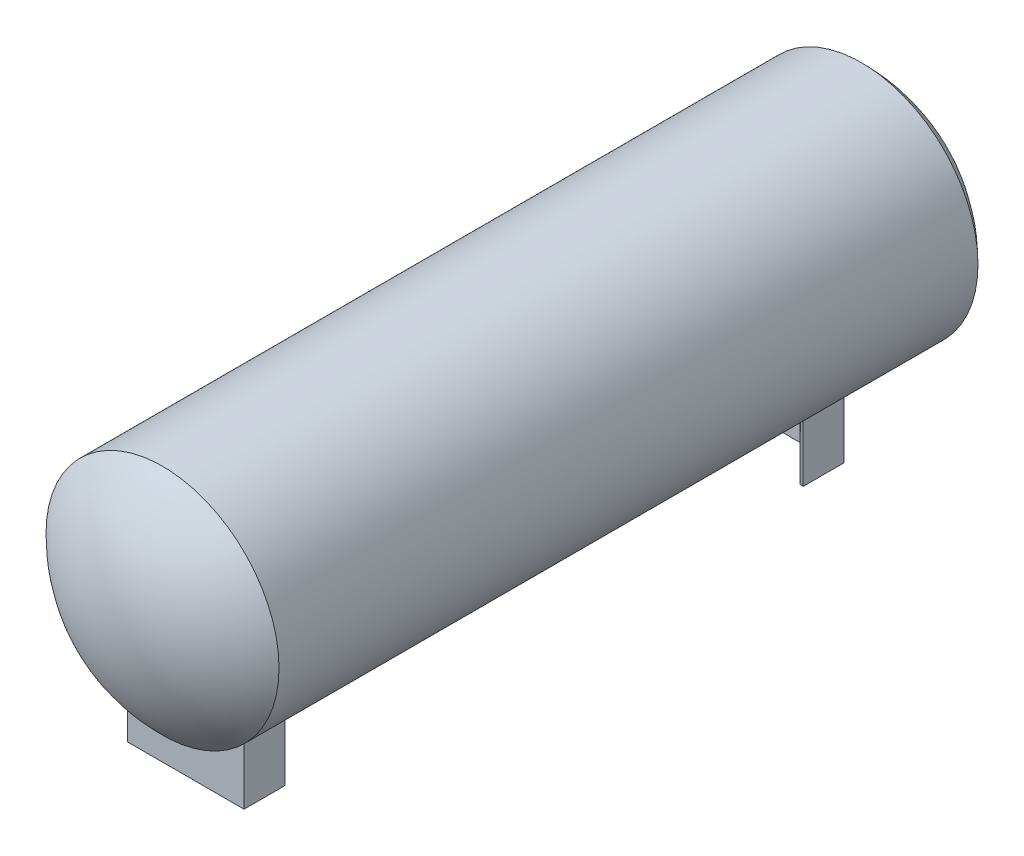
ISO-10303-21;
HEADER;
FILE_DESCRIPTION(('STEP AP214'),'2;1');
FILE_NAME('part.step','',(''),(''),'','','');
FILE_SCHEMA(('AUTOMOTIVE_DESIGN { 1 0 10303 214 1 1 1 1 }'));
ENDSEC;
DATA;
#1=APPLICATION_CONTEXT('core data for automotive mechanical design processes');
#2=APPLICATION_PROTOCOL_DEFINITION('international standard','automotive_design',2000,#1);
#3=PRODUCT_CONTEXT('',#1,'mechanical');
#4=PRODUCT('Part','Part','',(#3));
#5=PRODUCT_RELATED_PRODUCT_CATEGORY('part','',(#4));
#6=PRODUCT_DEFINITION_FORMATION('','',#4);
#7=PRODUCT_DEFINITION_CONTEXT('part definition',#1,'design');
#8=PRODUCT_DEFINITION('design','',#6,#7);
#9=PRODUCT_DEFINITION_SHAPE('','',#8);
#10=(LENGTH_UNIT() NAMED_UNIT(*) SI_UNIT(.MILLI.,.METRE.));
#11=(NAMED_UNIT(*) PLANE_ANGLE_UNIT() SI_UNIT($,.RADIAN.));
#12=(NAMED_UNIT(*) SI_UNIT($,.STERADIAN.) SOLID_ANGLE_UNIT());
#13=UNCERTAINTY_MEASURE_WITH_UNIT(LENGTH_MEASURE(1.E-05),#10,'distance_accuracy_value','');
#14=(GEOMETRIC_REPRESENTATION_CONTEXT(3) GLOBAL_UNCERTAINTY_ASSIGNED_CONTEXT((#13)) GLOBAL_UNIT_ASSIGNED_CONTEXT((#10,
#11,#12)) REPRESENTATION_CONTEXT('',''));
#15=CARTESIAN_POINT('',(0.,0.,0.));
#16=DIRECTION('',(0.,0.,1.));
#17=DIRECTION('',(1.,0.,0.));
#18=AXIS2_PLACEMENT_3D('',#15,#16,#17);
#19=CARTESIAN_POINT('',(0.,0.,-256.565921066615));
#20=DIRECTION('',(0.,0.,-1.));
#21=DIRECTION('',(1.,0.,0.));
#22=AXIS2_PLACEMENT_3D('',#19,#20,#21);
#23=SPHERICAL_SURFACE('',#22,177.8);
#24=CARTESIAN_POINT('',(0.,0.,-381.));
#25=DIRECTION('',(0.,0.,-1.));
#26=DIRECTION('',(-1.,0.,0.));
#27=AXIS2_PLACEMENT_3D('',#24,#25,#26);
#28=CIRCLE('',#27,127.);
#29=CARTESIAN_POINT('',(-127.,0.,-381.));
#30=VERTEX_POINT('',#29);
#31=EDGE_CURVE('E350',#30,#30,#28,.T.);
#32=ORIENTED_EDGE('',*,*,#31,.T.);
#33=EDGE_LOOP('',(#32));
#34=FACE_BOUND('',#33,.T.);
#35=ADVANCED_FACE('F32',(#34),#23,.T.);
#36=CARTESIAN_POINT('',(0.,0.,-434.365921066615));
#37=DIRECTION('',(0.,0.,-1.));
#38=DIRECTION('',(-1.,0.,0.));
#39=AXIS2_PLACEMENT_3D('',#36,#37,#38);
#40=CYLINDRICAL_SURFACE('',#39,127.);
#41=CARTESIAN_POINT('',(45.8298958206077,-118.442478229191,-278.892));
#42=CARTESIAN_POINT('',(46.0515160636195,-118.356725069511,-278.89199953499));
#43=CARTESIAN_POINT('',(46.2728815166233,-118.270353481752,-278.902004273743));
#44=CARTESIAN_POINT('',(46.7136488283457,-118.096956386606,-278.941859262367));
#45=CARTESIAN_POINT('',(46.9330500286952,-118.009930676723,-278.971715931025));
#46=CARTESIAN_POINT('',(47.368550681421,-117.835798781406,-279.051090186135));
#47=CARTESIAN_POINT('',(47.5846457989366,-117.748692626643,-279.100631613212));
#48=CARTESIAN_POINT('',(48.0118380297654,-117.575152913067,-279.219091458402));
#49=CARTESIAN_POINT('',(48.222933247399,-117.488719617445,-279.288017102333));
#50=CARTESIAN_POINT('',(48.6385775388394,-117.317259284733,-279.444879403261));
#51=CARTESIAN_POINT('',(48.8431255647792,-117.232232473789,-279.532819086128));
#52=CARTESIAN_POINT('',(49.2441312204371,-117.064353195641,-279.727257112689));
#53=CARTESIAN_POINT('',(49.4405891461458,-116.981500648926,-279.833754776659));
#54=CARTESIAN_POINT('',(49.8238993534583,-116.818758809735,-280.064780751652));
#55=CARTESIAN_POINT('',(50.0107518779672,-116.73886944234,-280.189308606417));
#56=CARTESIAN_POINT('',(50.3732171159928,-116.58292287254,-280.455695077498));
#57=CARTESIAN_POINT('',(50.5488358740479,-116.506863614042,-280.59754425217));
#58=CARTESIAN_POINT('',(50.8831147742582,-116.36125229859,-280.894084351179));
#59=CARTESIAN_POINT('',(51.0420902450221,-116.291584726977,-281.048362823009));
#60=CARTESIAN_POINT('',(51.3464297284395,-116.157530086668,-281.37178593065));
#61=CARTESIAN_POINT('',(51.4918000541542,-116.093140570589,-281.540923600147));
#62=CARTESIAN_POINT('',(51.7675164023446,-115.970457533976,-281.893069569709));
#63=CARTESIAN_POINT('',(51.8978641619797,-115.912163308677,-282.076076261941));
#64=CARTESIAN_POINT('',(52.1420895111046,-115.802506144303,-282.454724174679));
#65=CARTESIAN_POINT('',(52.2559686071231,-115.75114257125,-282.650364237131));
#66=CARTESIAN_POINT('',(52.4575273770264,-115.659928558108,-283.036803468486));
#67=CARTESIAN_POINT('',(52.5465693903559,-115.619487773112,-283.226753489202));
#68=CARTESIAN_POINT('',(52.7085103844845,-115.545752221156,-283.614745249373));
#69=CARTESIAN_POINT('',(52.7814109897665,-115.512456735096,-283.812786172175));
#70=CARTESIAN_POINT('',(52.9101583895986,-115.453541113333,-284.215337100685));
#71=CARTESIAN_POINT('',(52.9660139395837,-115.427917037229,-284.419843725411));
#72=CARTESIAN_POINT('',(53.060000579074,-115.384743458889,-284.83372401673));
#73=CARTESIAN_POINT('',(53.0981329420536,-115.367193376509,-285.043097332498));
#74=CARTESIAN_POINT('',(53.1536927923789,-115.341604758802,-285.446898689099));
#75=CARTESIAN_POINT('',(53.1726074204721,-115.332883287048,-285.641080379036));
#76=CARTESIAN_POINT('',(53.1949647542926,-115.322573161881,-286.030517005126));
#77=CARTESIAN_POINT('',(53.1984083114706,-115.320984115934,-286.225771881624));
#78=CARTESIAN_POINT('',(53.1897848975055,-115.324961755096,-286.615821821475));
#79=CARTESIAN_POINT('',(53.1777212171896,-115.330526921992,-286.8106169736));
#80=CARTESIAN_POINT('',(53.1382294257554,-115.348727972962,-287.19830878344));
#81=CARTESIAN_POINT('',(53.1108013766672,-115.361363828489,-287.391205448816));
#82=CARTESIAN_POINT('',(53.0420887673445,-115.392972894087,-287.76713507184));
#83=CARTESIAN_POINT('',(53.0013087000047,-115.41171526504,-287.950280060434));
#84=CARTESIAN_POINT('',(52.9061132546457,-115.455384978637,-288.312298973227));
#85=CARTESIAN_POINT('',(52.8516933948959,-115.480314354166,-288.49117147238));
#86=CARTESIAN_POINT('',(52.7297798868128,-115.53603246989,-288.843397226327));
#87=CARTESIAN_POINT('',(52.6622901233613,-115.566819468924,-289.016752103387));
#88=CARTESIAN_POINT('',(52.5148287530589,-115.633902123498,-289.357036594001));
#89=CARTESIAN_POINT('',(52.4348524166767,-115.670199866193,-289.523963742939));
#90=CARTESIAN_POINT('',(52.2601704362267,-115.749229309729,-289.856044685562));
#91=CARTESIAN_POINT('',(52.1650518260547,-115.792139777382,-290.020938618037));
#92=CARTESIAN_POINT('',(51.9630168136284,-115.882945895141,-290.341964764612));
#93=CARTESIAN_POINT('',(51.8560961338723,-115.930843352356,-290.49809377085));
#94=CARTESIAN_POINT('',(51.6313598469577,-116.031107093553,-290.800740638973));
#95=CARTESIAN_POINT('',(51.513545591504,-116.083472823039,-290.947259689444));
#96=CARTESIAN_POINT('',(51.2678444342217,-116.192195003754,-291.230100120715));
#97=CARTESIAN_POINT('',(51.1399537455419,-116.2485529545,-291.36641762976));
#98=CARTESIAN_POINT('',(50.8646111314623,-116.369307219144,-291.638514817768));
#99=CARTESIAN_POINT('',(50.7164117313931,-116.433987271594,-291.773412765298));
#100=CARTESIAN_POINT('',(50.4104056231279,-116.566799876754,-292.030069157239));
#101=CARTESIAN_POINT('',(50.2525955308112,-116.634933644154,-292.151822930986));
#102=CARTESIAN_POINT('',(49.9284719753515,-116.77405014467,-292.381651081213));
#103=CARTESIAN_POINT('',(49.7621574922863,-116.84503321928,-292.489723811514));
#104=CARTESIAN_POINT('',(49.4221009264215,-116.989273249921,-292.691749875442));
#105=CARTESIAN_POINT('',(49.2483583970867,-117.062530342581,-292.785702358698));
#106=CARTESIAN_POINT('',(48.8800973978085,-117.21680379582,-292.966175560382));
#107=CARTESIAN_POINT('',(48.6850384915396,-117.297966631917,-293.051470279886));
#108=CARTESIAN_POINT('',(48.2888372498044,-117.461628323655,-293.204701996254));
#109=CARTESIAN_POINT('',(48.0876965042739,-117.544126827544,-293.272643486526));
#110=CARTESIAN_POINT('',(47.6804681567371,-117.7099031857,-293.390903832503));
#111=CARTESIAN_POINT('',(47.4743777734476,-117.793181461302,-293.441212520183));
#112=CARTESIAN_POINT('',(47.0587530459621,-117.959840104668,-293.523861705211));
#113=CARTESIAN_POINT('',(46.8492198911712,-118.043220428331,-293.556208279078));
#114=CARTESIAN_POINT('',(46.4183674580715,-118.213329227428,-293.603797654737));
#115=CARTESIAN_POINT('',(46.1969460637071,-118.300037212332,-293.618194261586));
#116=CARTESIAN_POINT('',(45.7533522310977,-118.472306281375,-293.62694114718));
#117=CARTESIAN_POINT('',(45.5311800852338,-118.557867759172,-293.621298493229));
#118=CARTESIAN_POINT('',(45.0874990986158,-118.727308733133,-293.589867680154));
#119=CARTESIAN_POINT('',(44.865990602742,-118.811187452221,-293.564070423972));
#120=CARTESIAN_POINT('',(44.425478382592,-118.976603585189,-293.492317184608));
#121=CARTESIAN_POINT('',(44.2064736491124,-119.058141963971,-293.446369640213));
#122=CARTESIAN_POINT('',(43.7741178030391,-119.21778113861,-293.334808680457));
#123=CARTESIAN_POINT('',(43.5607375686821,-119.295902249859,-293.269337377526));
#124=CARTESIAN_POINT('',(43.1398267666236,-119.448756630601,-293.118861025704));
#125=CARTESIAN_POINT('',(42.9322938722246,-119.523491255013,-293.033863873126));
#126=CARTESIAN_POINT('',(42.5247381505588,-119.669099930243,-292.844680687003));
#127=CARTESIAN_POINT('',(42.3247155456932,-119.739973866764,-292.740494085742));
#128=CARTESIAN_POINT('',(41.9339782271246,-119.877372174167,-292.513463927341));
#129=CARTESIAN_POINT('',(41.7432630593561,-119.943896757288,-292.390621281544));
#130=CARTESIAN_POINT('',(41.3817033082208,-120.06910299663,-292.133238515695));
#131=CARTESIAN_POINT('',(41.2103454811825,-120.128006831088,-291.999527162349));
#132=CARTESIAN_POINT('',(40.879250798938,-120.241080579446,-291.716615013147));
#133=CARTESIAN_POINT('',(40.719513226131,-120.295250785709,-291.567415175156));
#134=CARTESIAN_POINT('',(40.4131982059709,-120.398503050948,-291.254525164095));
#135=CARTESIAN_POINT('',(40.2666174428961,-120.447586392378,-291.09083866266));
#136=CARTESIAN_POINT('',(39.9880197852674,-120.540366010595,-290.750089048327));
#137=CARTESIAN_POINT('',(39.8560021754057,-120.584062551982,-290.573026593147));
#138=CARTESIAN_POINT('',(39.6151299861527,-120.663402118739,-290.217547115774));
#139=CARTESIAN_POINT('',(39.5053731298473,-120.699366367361,-290.039812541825));
#140=CARTESIAN_POINT('',(39.3010048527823,-120.766065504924,-289.674908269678));
#141=CARTESIAN_POINT('',(39.2063925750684,-120.796800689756,-289.487739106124));
#142=CARTESIAN_POINT('',(39.0332460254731,-120.852860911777,-289.105375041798));
#143=CARTESIAN_POINT('',(38.9547082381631,-120.878187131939,-288.910181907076));
#144=CARTESIAN_POINT('',(38.8144657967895,-120.92329253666,-288.513217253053));
#145=CARTESIAN_POINT('',(38.7527606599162,-120.943071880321,-288.311445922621));
#146=CARTESIAN_POINT('',(38.6492105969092,-120.976201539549,-287.912177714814));
#147=CARTESIAN_POINT('',(38.6065919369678,-120.989802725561,-287.714901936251));
#148=CARTESIAN_POINT('',(38.5376609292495,-121.011776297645,-287.317237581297));
#149=CARTESIAN_POINT('',(38.5113480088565,-121.020148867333,-287.116849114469));
#150=CARTESIAN_POINT('',(38.4752785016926,-121.031621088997,-286.71446417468));
#151=CARTESIAN_POINT('',(38.4655197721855,-121.034721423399,-286.512467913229));
#152=CARTESIAN_POINT('',(38.4626447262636,-121.035635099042,-286.108344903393));
#153=CARTESIAN_POINT('',(38.4695282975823,-121.033448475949,-285.906218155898));
#154=CARTESIAN_POINT('',(38.4995452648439,-121.023903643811,-285.507672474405));
#155=CARTESIAN_POINT('',(38.5223263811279,-121.016657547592,-285.31122420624));
#156=CARTESIAN_POINT('',(38.5835634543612,-120.997147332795,-284.920970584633));
#157=CARTESIAN_POINT('',(38.6220247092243,-120.98488151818,-284.727166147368));
#158=CARTESIAN_POINT('',(38.7142664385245,-120.955396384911,-284.343669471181));
#159=CARTESIAN_POINT('',(38.7680435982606,-120.938178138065,-284.153976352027));
#160=CARTESIAN_POINT('',(38.8904449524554,-120.898872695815,-283.779956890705));
#161=CARTESIAN_POINT('',(38.9590696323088,-120.876785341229,-283.595630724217));
#162=CARTESIAN_POINT('',(39.1109277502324,-120.827735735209,-283.232723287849));
#163=CARTESIAN_POINT('',(39.1942292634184,-120.800750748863,-283.054173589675));
#164=CARTESIAN_POINT('',(39.3744992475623,-120.742112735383,-282.704912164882));
#165=CARTESIAN_POINT('',(39.4714680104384,-120.710459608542,-282.534200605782));
#166=CARTESIAN_POINT('',(39.678239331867,-120.642650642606,-282.20172132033));
#167=CARTESIAN_POINT('',(39.7880397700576,-120.606495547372,-282.039952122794));
#168=CARTESIAN_POINT('',(40.0196316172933,-120.52984677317,-281.726243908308));
#169=CARTESIAN_POINT('',(40.1414272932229,-120.489351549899,-281.574308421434));
#170=CARTESIAN_POINT('',(40.3996481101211,-120.403021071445,-281.277013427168));
#171=CARTESIAN_POINT('',(40.5363912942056,-120.357066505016,-281.131964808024));
#172=CARTESIAN_POINT('',(40.8204726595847,-120.261014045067,-280.854006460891));
#173=CARTESIAN_POINT('',(40.9678154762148,-120.210914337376,-280.721102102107));
#174=CARTESIAN_POINT('',(41.2719296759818,-120.106842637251,-280.468179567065));
#175=CARTESIAN_POINT('',(41.4287025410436,-120.052870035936,-280.348163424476));
#176=CARTESIAN_POINT('',(41.7505012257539,-119.941338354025,-280.121615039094));
#177=CARTESIAN_POINT('',(41.9155274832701,-119.883779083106,-280.015083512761));
#178=CARTESIAN_POINT('',(42.2608831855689,-119.762485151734,-279.811120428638));
#179=CARTESIAN_POINT('',(42.4415664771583,-119.698586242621,-279.71438538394));
#180=CARTESIAN_POINT('',(42.8093254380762,-119.567553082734,-279.53670495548));
#181=CARTESIAN_POINT('',(42.9963992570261,-119.500419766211,-279.455755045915));
#182=CARTESIAN_POINT('',(43.3755487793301,-119.363320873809,-279.309952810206));
#183=CARTESIAN_POINT('',(43.5676210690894,-119.293357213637,-279.245089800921));
#184=CARTESIAN_POINT('',(43.9555370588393,-119.150969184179,-279.131600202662));
#185=CARTESIAN_POINT('',(44.1513798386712,-119.078545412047,-279.082969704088));
#186=CARTESIAN_POINT('',(44.5929911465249,-118.913973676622,-278.992307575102));
#187=CARTESIAN_POINT('',(44.8394612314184,-118.821263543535,-278.954660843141));
#188=CARTESIAN_POINT('',(45.3340256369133,-118.633452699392,-278.904507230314));
#189=CARTESIAN_POINT('',(45.5821199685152,-118.538351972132,-278.89200051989));
#190=CARTESIAN_POINT('',(45.8298958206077,-118.442478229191,-278.892));
#191=B_SPLINE_CURVE_WITH_KNOTS('',3,(#41,#42,#43,#44,#45,#46,#47,#48,#49,#50,#51,#52,#53,#54,
#55,#56,#57,#58,#59,#60,#61,#62,#63,#64,#65,#66,#67,#68,#69,#70,#71,#72,#73,#74,#75,#76,#77,#78,
#79,#80,#81,#82,#83,#84,#85,#86,#87,#88,#89,#90,#91,#92,#93,#94,#95,#96,#97,#98,#99,#100,#101,
#102,#103,#104,#105,#106,#107,#108,#109,#110,#111,#112,#113,#114,#115,#116,#117,#118,#119,#120,
#121,#122,#123,#124,#125,#126,#127,#128,#129,#130,#131,#132,#133,#134,#135,#136,#137,#138,#139,
#140,#141,#142,#143,#144,#145,#146,#147,#148,#149,#150,#151,#152,#153,#154,#155,#156,#157,#158,
#159,#160,#161,#162,#163,#164,#165,#166,#167,#168,#169,#170,#171,#172,#173,#174,#175,#176,#177,
#178,#179,#180,#181,#182,#183,#184,#185,#186,#187,#188,#189,#190),.UNSPECIFIED.,.T.,.F.,(4,2,2,
2,2,2,2,2,2,2,2,2,2,2,2,2,2,2,2,2,2,2,2,2,2,2,2,2,2,2,2,2,2,2,2,2,2,2,2,2,2,2,2,2,2,2,2,2,2,2,2,
2,2,2,2,2,2,2,2,2,2,2,2,2,2,2,2,2,2,2,2,2,2,2,4),(0.,0.712663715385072,1.42555797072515,
2.13931827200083,2.85334499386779,3.56748542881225,4.28159971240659,4.99569592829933,
5.70940462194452,6.4051721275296,7.10061516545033,7.7959777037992,8.49127659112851,
9.13136530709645,9.77138957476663,10.4110845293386,11.0507335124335,11.6358893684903,
12.2210130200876,12.8060125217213,13.3910096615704,13.9560549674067,14.5212861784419,
15.0863496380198,15.6516276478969,16.2364075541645,16.8214001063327,17.4063201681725,
17.9914611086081,18.6225219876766,19.2538063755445,19.8851666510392,20.5165649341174,
21.1993181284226,21.8818943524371,22.5648635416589,23.2476015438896,23.9614384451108,
24.6750236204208,25.388931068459,26.102539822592,26.8110760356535,27.5193262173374,
28.2275973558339,28.9358339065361,29.6105513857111,30.2852271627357,30.9597324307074,
31.6342045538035,32.2693040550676,32.9043676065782,33.5392921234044,34.1741984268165,
34.7803127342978,35.386405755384,35.9924203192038,36.5984307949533,37.1914220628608,
37.7846138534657,38.3776773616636,38.9707602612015,39.5666701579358,40.1625927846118,
40.7584170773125,41.3544540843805,41.9674806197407,42.5807768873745,43.19416978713,
43.8075952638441,44.4509161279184,45.0940522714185,45.7367601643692,46.3793131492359,
47.1760799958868,47.9728522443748),.UNSPECIFIED.);
#192=CARTESIAN_POINT('',(53.0956591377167,-115.368327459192,-287.469048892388));
#193=VERTEX_POINT('',#192);
#194=CARTESIAN_POINT('',(45.8298958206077,-118.442478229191,-293.624));
#195=VERTEX_POINT('',#194);
#196=EDGE_CURVE('E11',#193,#195,#191,.T.);
#197=ORIENTED_EDGE('',*,*,#196,.F.);
#198=CARTESIAN_POINT('',(0.,0.,-606.019765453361));
#199=DIRECTION('',(-0.986391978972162,0.,0.16441065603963));
#200=DIRECTION('',(-0.16441065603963,0.,-0.986391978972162));
#201=AXIS2_PLACEMENT_3D('',#198,#199,#200);
#202=ELLIPSE('',#201,772.456013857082,127.);
#203=CARTESIAN_POINT('',(58.285106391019,-112.835483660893,-256.334636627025));
#204=VERTEX_POINT('',#203);
#205=EDGE_CURVE('E198',#204,#193,#202,.F.);
#206=ORIENTED_EDGE('',*,*,#205,.F.);
#207=CARTESIAN_POINT('',(61.0410855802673,-111.368693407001,-254.));
#208=CARTESIAN_POINT('',(60.867766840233,-111.463688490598,-254.000004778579));
#209=CARTESIAN_POINT('',(60.6940759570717,-111.558357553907,-254.016147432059));
#210=CARTESIAN_POINT('',(60.3507716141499,-111.744452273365,-254.080977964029));
#211=CARTESIAN_POINT('',(60.1811647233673,-111.835872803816,-254.129715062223));
#212=CARTESIAN_POINT('',(59.8508899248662,-112.012973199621,-254.259942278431));
#213=CARTESIAN_POINT('',(59.6902516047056,-112.098634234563,-254.341534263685));
#214=CARTESIAN_POINT('',(59.3845934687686,-112.260856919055,-254.536716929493));
#215=CARTESIAN_POINT('',(59.2395624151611,-112.337425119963,-254.650284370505));
#216=CARTESIAN_POINT('',(58.982746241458,-112.472463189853,-254.896991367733));
#217=CARTESIAN_POINT('',(58.8692051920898,-112.531905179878,-255.027742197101));
#218=CARTESIAN_POINT('',(58.7172371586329,-112.611231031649,-255.240364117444));
#219=CARTESIAN_POINT('',(58.6696318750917,-112.63603683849,-255.314001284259));
#220=CARTESIAN_POINT('',(58.5811501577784,-112.682080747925,-255.466255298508));
#221=CARTESIAN_POINT('',(58.5402727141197,-112.703319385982,-255.544871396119));
#222=CARTESIAN_POINT('',(58.4380406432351,-112.756378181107,-255.767000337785));
#223=CARTESIAN_POINT('',(58.3842380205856,-112.784231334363,-255.915072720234));
#224=CARTESIAN_POINT('',(58.3021710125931,-112.826676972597,-256.219828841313));
#225=CARTESIAN_POINT('',(58.2738879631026,-112.841279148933,-256.376506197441));
#226=CARTESIAN_POINT('',(58.2458027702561,-112.855778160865,-256.677841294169));
#227=CARTESIAN_POINT('',(58.2435296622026,-112.856950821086,-256.822210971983));
#228=CARTESIAN_POINT('',(58.261203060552,-112.847828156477,-257.10919036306));
#229=CARTESIAN_POINT('',(58.2811446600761,-112.837535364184,-257.251800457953));
#230=CARTESIAN_POINT('',(58.341464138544,-112.80635912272,-257.527390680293));
#231=CARTESIAN_POINT('',(58.3812891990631,-112.785762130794,-257.660525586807));
#232=CARTESIAN_POINT('',(58.4793689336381,-112.734938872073,-257.917837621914));
#233=CARTESIAN_POINT('',(58.537625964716,-112.704711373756,-258.042013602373));
#234=CARTESIAN_POINT('',(58.6732827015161,-112.63415100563,-258.283975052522));
#235=CARTESIAN_POINT('',(58.7514151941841,-112.59343026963,-258.401234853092));
#236=CARTESIAN_POINT('',(58.9225231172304,-112.50398029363,-258.620891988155));
#237=CARTESIAN_POINT('',(59.0155035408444,-112.455248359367,-258.723284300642));
#238=CARTESIAN_POINT('',(59.2228040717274,-112.346225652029,-258.920652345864));
#239=CARTESIAN_POINT('',(59.3383097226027,-112.285278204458,-259.014017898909));
#240=CARTESIAN_POINT('',(59.5801444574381,-112.157144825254,-259.180134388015));
#241=CARTESIAN_POINT('',(59.706478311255,-112.089956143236,-259.252876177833));
#242=CARTESIAN_POINT('',(59.981697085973,-111.942945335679,-259.384361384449));
#243=CARTESIAN_POINT('',(60.1315061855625,-111.862558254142,-259.440540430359));
#244=CARTESIAN_POINT('',(60.436557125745,-111.698042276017,-259.526420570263));
#245=CARTESIAN_POINT('',(60.591801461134,-111.613911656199,-259.556109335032));
#246=CARTESIAN_POINT('',(60.9194283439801,-111.435458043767,-259.590667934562));
#247=CARTESIAN_POINT('',(61.0919984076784,-111.340944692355,-259.59281793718));
#248=CARTESIAN_POINT('',(61.4348055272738,-111.152161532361,-259.565464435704));
#249=CARTESIAN_POINT('',(61.6050416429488,-111.057891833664,-259.535948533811));
#250=CARTESIAN_POINT('',(61.9452704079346,-110.868493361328,-259.443744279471));
#251=CARTESIAN_POINT('',(62.114987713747,-110.773477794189,-259.379791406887));
#252=CARTESIAN_POINT('',(62.4415688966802,-110.589717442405,-259.218514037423));
#253=CARTESIAN_POINT('',(62.5984329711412,-110.500972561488,-259.12119005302));
#254=CARTESIAN_POINT('',(62.8857961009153,-110.337675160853,-258.89984991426));
#255=CARTESIAN_POINT('',(63.017226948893,-110.262632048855,-258.777431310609));
#256=CARTESIAN_POINT('',(63.1968093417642,-110.159739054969,-258.573752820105));
#257=CARTESIAN_POINT('',(63.2537560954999,-110.12704566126,-258.502495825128));
#258=CARTESIAN_POINT('',(63.3610315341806,-110.065360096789,-258.353704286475));
#259=CARTESIAN_POINT('',(63.4113649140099,-110.036365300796,-258.276174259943));
#260=CARTESIAN_POINT('',(63.4985853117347,-109.986053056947,-258.12579728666));
#261=CARTESIAN_POINT('',(63.5363693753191,-109.964227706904,-258.053638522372));
#262=CARTESIAN_POINT('',(63.6057744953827,-109.924096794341,-257.905525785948));
#263=CARTESIAN_POINT('',(63.6373993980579,-109.905789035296,-257.82957421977));
#264=CARTESIAN_POINT('',(63.6940048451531,-109.872994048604,-257.67448842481));
#265=CARTESIAN_POINT('',(63.7189900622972,-109.858504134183,-257.595356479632));
#266=CARTESIAN_POINT('',(63.7619272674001,-109.833588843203,-257.434615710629));
#267=CARTESIAN_POINT('',(63.7798802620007,-109.823162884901,-257.353007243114));
#268=CARTESIAN_POINT('',(63.8187714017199,-109.800570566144,-257.128197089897));
#269=CARTESIAN_POINT('',(63.8324465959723,-109.792617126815,-256.983212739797));
#270=CARTESIAN_POINT('',(63.8370301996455,-109.78995206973,-256.692876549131));
#271=CARTESIAN_POINT('',(63.8279477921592,-109.795235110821,-256.54752488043));
#272=CARTESIAN_POINT('',(63.7888307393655,-109.817965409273,-256.269798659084));
#273=CARTESIAN_POINT('',(63.7601088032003,-109.83465051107,-256.137173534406));
#274=CARTESIAN_POINT('',(63.6844649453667,-109.878527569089,-255.879081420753));
#275=CARTESIAN_POINT('',(63.637541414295,-109.905720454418,-255.75361506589));
#276=CARTESIAN_POINT('',(63.5253956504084,-109.970579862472,-255.508103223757));
#277=CARTESIAN_POINT('',(63.4595555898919,-110.008599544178,-255.388435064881));
#278=CARTESIAN_POINT('',(63.3129076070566,-110.093064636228,-255.16198289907));
#279=CARTESIAN_POINT('',(63.2320950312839,-110.139512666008,-255.055202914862));
#280=CARTESIAN_POINT('',(63.0487375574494,-110.24458709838,-254.845361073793));
#281=CARTESIAN_POINT('',(62.9447941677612,-110.30398397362,-254.743909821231));
#282=CARTESIAN_POINT('',(62.7248547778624,-110.429201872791,-254.559729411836));
#283=CARTESIAN_POINT('',(62.60884962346,-110.495027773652,-254.477014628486));
#284=CARTESIAN_POINT('',(62.3517389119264,-110.640341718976,-254.321329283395));
#285=CARTESIAN_POINT('',(62.2093439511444,-110.720484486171,-254.251100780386));
#286=CARTESIAN_POINT('',(61.9167495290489,-110.884373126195,-254.136117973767));
#287=CARTESIAN_POINT('',(61.7665559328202,-110.96811628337,-254.091344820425));
#288=CARTESIAN_POINT('',(61.5198626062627,-111.104987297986,-254.039638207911));
#289=CARTESIAN_POINT('',(61.4246823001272,-111.157637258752,-254.024788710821));
#290=CARTESIAN_POINT('',(61.2334014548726,-111.263122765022,-254.004967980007));
#291=CARTESIAN_POINT('',(61.137300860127,-111.315958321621,-253.999997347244));
#292=CARTESIAN_POINT('',(61.0410855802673,-111.368693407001,-254.));
#293=B_SPLINE_CURVE_WITH_KNOTS('',3,(#207,#208,#209,#210,#211,#212,#213,#214,#215,#216,#217,
#218,#219,#220,#221,#222,#223,#224,#225,#226,#227,#228,#229,#230,#231,#232,#233,#234,#235,#236,
#237,#238,#239,#240,#241,#242,#243,#244,#245,#246,#247,#248,#249,#250,#251,#252,#253,#254,#255,
#256,#257,#258,#259,#260,#261,#262,#263,#264,#265,#266,#267,#268,#269,#270,#271,#272,#273,#274,
#275,#276,#277,#278,#279,#280,#281,#282,#283,#284,#285,#286,#287,#288,#289,#290,#291,#292),
.UNSPECIFIED.,.T.,.F.,(4,2,2,2,2,2,2,2,2,2,2,2,2,2,2,2,2,2,2,2,2,2,2,2,2,2,2,2,2,2,2,2,2,2,2,2,
2,2,2,2,2,2,4),(0.,0.592551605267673,1.18600002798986,1.78130279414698,2.37617401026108,
2.92195190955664,3.19493363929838,3.46787435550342,3.94496026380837,4.42169696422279,
4.85271958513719,5.28364701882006,5.70320995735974,6.12282656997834,6.561005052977,
6.99933120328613,7.47899599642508,7.95887318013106,8.49381979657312,9.02901526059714,
9.61670260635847,10.2046201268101,10.8157653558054,11.4269011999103,12.0071513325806,
12.2974364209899,12.5875143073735,12.8401319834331,13.0925913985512,13.3448726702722,
13.5971178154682,14.0321382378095,14.4669831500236,14.8752862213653,15.2836254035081,
15.7072113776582,16.1309292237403,16.5998290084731,17.0690872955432,17.6005043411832,
18.1315273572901,18.4604534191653,18.7893994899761),.UNSPECIFIED.);
#294=CARTESIAN_POINT('',(61.0410855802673,-111.368693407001,-254.));
#295=VERTEX_POINT('',#294);
#296=EDGE_CURVE('E673',#295,#204,#293,.T.);
#297=ORIENTED_EDGE('',*,*,#296,.F.);
#298=CARTESIAN_POINT('',(0.,0.,-254.));
#299=DIRECTION('',(0.,0.,1.));
#300=DIRECTION('',(1.,0.,0.));
#301=AXIS2_PLACEMENT_3D('',#298,#299,#300);
#302=CIRCLE('',#301,127.);
#303=CARTESIAN_POINT('',(63.4999999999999,-109.985226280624,-254.));
#304=VERTEX_POINT('',#303);
#305=EDGE_CURVE('E671',#304,#295,#302,.F.);
#306=ORIENTED_EDGE('',*,*,#305,.F.);
#307=DIRECTION('',(0.,0.,-1.));
#308=VECTOR('',#307,1.);
#309=CARTESIAN_POINT('',(63.4999999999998,-109.985226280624,-434.365921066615));
#310=LINE('',#309,#308);
#311=CARTESIAN_POINT('',(63.4999999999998,-109.985226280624,-298.45));
#312=VERTEX_POINT('',#311);
#313=EDGE_CURVE('E669',#312,#304,#310,.F.);
#314=ORIENTED_EDGE('',*,*,#313,.F.);
#315=CARTESIAN_POINT('',(0.,0.,-298.45));
#316=DIRECTION('',(0.,0.,-1.));
#317=DIRECTION('',(-1.,0.,0.));
#318=AXIS2_PLACEMENT_3D('',#315,#316,#317);
#319=CIRCLE('',#318,127.);
#320=CARTESIAN_POINT('',(-63.5,-109.985226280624,-298.45));
#321=VERTEX_POINT('',#320);
#322=EDGE_CURVE('E667',#321,#312,#319,.F.);
#323=ORIENTED_EDGE('',*,*,#322,.F.);
#324=DIRECTION('',(0.,0.,-1.));
#325=VECTOR('',#324,1.);
#326=CARTESIAN_POINT('',(-63.5,-109.985226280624,-434.365921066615));
#327=LINE('',#326,#325);
#328=CARTESIAN_POINT('',(-63.5,-109.985226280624,-254.));
#329=VERTEX_POINT('',#328);
#330=EDGE_CURVE('E663',#329,#321,#327,.T.);
#331=ORIENTED_EDGE('',*,*,#330,.F.);
#332=CARTESIAN_POINT('',(0.,0.,-254.));
#333=DIRECTION('',(0.,0.,1.));
#334=DIRECTION('',(1.,0.,0.));
#335=AXIS2_PLACEMENT_3D('',#332,#333,#334);
#336=CIRCLE('',#335,127.);
#337=CARTESIAN_POINT('',(-61.0410855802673,-111.368693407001,-254.));
#338=VERTEX_POINT('',#337);
#339=EDGE_CURVE('E661',#338,#329,#336,.F.);
#340=ORIENTED_EDGE('',*,*,#339,.F.);
#341=CARTESIAN_POINT('',(-61.0410855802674,-111.368693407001,-254.));
#342=CARTESIAN_POINT('',(-61.2172887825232,-111.272115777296,-254.000004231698));
#343=CARTESIAN_POINT('',(-61.3934251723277,-111.175026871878,-254.016688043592));
#344=CARTESIAN_POINT('',(-61.7406520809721,-110.982572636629,-254.083212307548));
#345=CARTESIAN_POINT('',(-61.9117329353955,-110.887210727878,-254.133112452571));
#346=CARTESIAN_POINT('',(-62.2439528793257,-110.701068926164,-254.26583356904));
#347=CARTESIAN_POINT('',(-62.4050684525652,-110.610299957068,-254.34872921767));
#348=CARTESIAN_POINT('',(-62.7113152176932,-110.436958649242,-254.546798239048));
#349=CARTESIAN_POINT('',(-62.8564563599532,-110.354381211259,-254.661951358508));
#350=CARTESIAN_POINT('',(-63.0522717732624,-110.242533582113,-254.852581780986));
#351=CARTESIAN_POINT('',(-63.111905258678,-110.208401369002,-254.916274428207));
#352=CARTESIAN_POINT('',(-63.2256057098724,-110.143211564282,-255.04987146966));
#353=CARTESIAN_POINT('',(-63.2796761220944,-110.112152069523,-255.119771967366));
#354=CARTESIAN_POINT('',(-63.3814994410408,-110.053573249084,-255.265344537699));
#355=CARTESIAN_POINT('',(-63.4292563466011,-110.026051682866,-255.341012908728));
#356=CARTESIAN_POINT('',(-63.5177565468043,-109.974984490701,-255.497612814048));
#357=CARTESIAN_POINT('',(-63.5585012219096,-109.951438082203,-255.578543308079));
#358=CARTESIAN_POINT('',(-63.6270673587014,-109.911772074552,-255.73322239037));
#359=CARTESIAN_POINT('',(-63.6559008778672,-109.895073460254,-255.80637541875));
#360=CARTESIAN_POINT('',(-63.7074617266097,-109.865191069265,-255.955491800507));
#361=CARTESIAN_POINT('',(-63.7301901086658,-109.852006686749,-256.031454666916));
#362=CARTESIAN_POINT('',(-63.7691773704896,-109.829379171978,-256.185513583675));
#363=CARTESIAN_POINT('',(-63.7854411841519,-109.819933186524,-256.263607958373));
#364=CARTESIAN_POINT('',(-63.8112614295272,-109.804932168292,-256.421238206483));
#365=CARTESIAN_POINT('',(-63.8208185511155,-109.799376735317,-256.500773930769));
#366=CARTESIAN_POINT('',(-63.8376649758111,-109.789583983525,-256.721028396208));
#367=CARTESIAN_POINT('',(-63.8377860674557,-109.789513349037,-256.862573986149));
#368=CARTESIAN_POINT('',(-63.8167300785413,-109.801753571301,-257.143415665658));
#369=CARTESIAN_POINT('',(-63.7955578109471,-109.814061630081,-257.28271225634));
#370=CARTESIAN_POINT('',(-63.7340402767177,-109.849776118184,-257.550800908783));
#371=CARTESIAN_POINT('',(-63.6943181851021,-109.872821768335,-257.679785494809));
#372=CARTESIAN_POINT('',(-63.5977254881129,-109.928760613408,-257.928851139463));
#373=CARTESIAN_POINT('',(-63.5408517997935,-109.961655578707,-258.048930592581));
#374=CARTESIAN_POINT('',(-63.4081495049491,-110.038233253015,-258.284934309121));
#375=CARTESIAN_POINT('',(-63.3313675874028,-110.082456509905,-258.400144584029));
#376=CARTESIAN_POINT('',(-63.1636646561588,-110.178767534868,-258.616032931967));
#377=CARTESIAN_POINT('',(-63.0727377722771,-110.230858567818,-258.716704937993));
#378=CARTESIAN_POINT('',(-62.8678678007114,-110.34784401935,-258.91338371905));
#379=CARTESIAN_POINT('',(-62.7524733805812,-110.413524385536,-259.007409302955));
#380=CARTESIAN_POINT('',(-62.5106729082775,-110.550599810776,-259.174841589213));
#381=CARTESIAN_POINT('',(-62.3842613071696,-110.621997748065,-259.248237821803));
#382=CARTESIAN_POINT('',(-62.1064772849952,-110.778219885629,-259.382072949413));
#383=CARTESIAN_POINT('',(-61.9539961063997,-110.863583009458,-259.439587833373));
#384=CARTESIAN_POINT('',(-61.6427701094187,-111.036933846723,-259.527236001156));
#385=CARTESIAN_POINT('',(-61.4840222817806,-111.124922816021,-259.557355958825));
#386=CARTESIAN_POINT('',(-61.1493621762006,-111.30945690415,-259.591410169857));
#387=CARTESIAN_POINT('',(-60.9732031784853,-111.406051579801,-259.592710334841));
#388=CARTESIAN_POINT('',(-60.6226054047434,-111.597220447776,-259.562083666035));
#389=CARTESIAN_POINT('',(-60.4481671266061,-111.691794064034,-259.530147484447));
#390=CARTESIAN_POINT('',(-60.1040174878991,-111.877369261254,-259.432318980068));
#391=CARTESIAN_POINT('',(-59.9343909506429,-111.968312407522,-259.366012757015));
#392=CARTESIAN_POINT('',(-59.6081212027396,-112.142347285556,-259.199524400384));
#393=CARTESIAN_POINT('',(-59.4514736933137,-112.225441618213,-259.099353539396));
#394=CARTESIAN_POINT('',(-59.1687857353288,-112.374723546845,-258.875114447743));
#395=CARTESIAN_POINT('',(-59.0413390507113,-112.441706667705,-258.753358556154));
#396=CARTESIAN_POINT('',(-58.8093855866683,-112.563197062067,-258.484381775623));
#397=CARTESIAN_POINT('',(-58.7048559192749,-112.617716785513,-258.33718655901));
#398=CARTESIAN_POINT('',(-58.5357989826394,-112.705670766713,-258.041146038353));
#399=CARTESIAN_POINT('',(-58.4679317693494,-112.740874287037,-257.894733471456));
#400=CARTESIAN_POINT('',(-58.3580199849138,-112.797807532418,-257.5900800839));
#401=CARTESIAN_POINT('',(-58.315953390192,-112.819548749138,-257.431849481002));
#402=CARTESIAN_POINT('',(-58.2631220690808,-112.846840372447,-257.126711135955));
#403=CARTESIAN_POINT('',(-58.2494613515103,-112.853888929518,-256.980432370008));
#404=CARTESIAN_POINT('',(-58.2452811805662,-112.856046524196,-256.687475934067));
#405=CARTESIAN_POINT('',(-58.2547541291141,-112.851159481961,-256.540798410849));
#406=CARTESIAN_POINT('',(-58.2954140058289,-112.830160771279,-256.258070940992));
#407=CARTESIAN_POINT('',(-58.3256143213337,-112.814559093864,-256.121838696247));
#408=CARTESIAN_POINT('',(-58.4053309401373,-112.773309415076,-255.856774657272));
#409=CARTESIAN_POINT('',(-58.4548484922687,-112.747660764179,-255.727943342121));
#410=CARTESIAN_POINT('',(-58.5728631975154,-112.686397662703,-255.477159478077));
#411=CARTESIAN_POINT('',(-58.6418625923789,-112.650519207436,-255.355508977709));
#412=CARTESIAN_POINT('',(-58.7955755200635,-112.570368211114,-255.125692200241));
#413=CARTESIAN_POINT('',(-58.8802928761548,-112.52609362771,-255.0175292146));
#414=CARTESIAN_POINT('',(-59.0704307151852,-112.42640552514,-254.807889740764));
#415=CARTESIAN_POINT('',(-59.1769958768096,-112.370366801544,-254.707751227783));
#416=CARTESIAN_POINT('',(-59.4020403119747,-112.251564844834,-254.526653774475));
#417=CARTESIAN_POINT('',(-59.5205279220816,-112.188796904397,-254.445708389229));
#418=CARTESIAN_POINT('',(-59.7801894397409,-112.050671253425,-254.295693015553));
#419=CARTESIAN_POINT('',(-59.9224119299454,-111.974693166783,-254.229013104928));
#420=CARTESIAN_POINT('',(-60.213655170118,-111.818348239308,-254.120817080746));
#421=CARTESIAN_POINT('',(-60.3626703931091,-111.737984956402,-254.079280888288));
#422=CARTESIAN_POINT('',(-60.600558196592,-111.609059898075,-254.033514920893));
#423=CARTESIAN_POINT('',(-60.6883692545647,-111.561336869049,-254.020942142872));
#424=CARTESIAN_POINT('',(-60.8644876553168,-111.465349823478,-254.00418356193));
#425=CARTESIAN_POINT('',(-60.9527950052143,-111.417085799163,-253.999997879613));
#426=CARTESIAN_POINT('',(-61.0410855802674,-111.368693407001,-254.));
#427=B_SPLINE_CURVE_WITH_KNOTS('',3,(#341,#342,#343,#344,#345,#346,#347,#348,#349,#350,#351,
#352,#353,#354,#355,#356,#357,#358,#359,#360,#361,#362,#363,#364,#365,#366,#367,#368,#369,#370,
#371,#372,#373,#374,#375,#376,#377,#378,#379,#380,#381,#382,#383,#384,#385,#386,#387,#388,#389,
#390,#391,#392,#393,#394,#395,#396,#397,#398,#399,#400,#401,#402,#403,#404,#405,#406,#407,#408,
#409,#410,#411,#412,#413,#414,#415,#416,#417,#418,#419,#420,#421,#422,#423,#424,#425,#426),
.UNSPECIFIED.,.T.,.F.,(4,2,2,2,2,2,2,2,2,2,2,2,2,2,2,2,2,2,2,2,2,2,2,2,2,2,2,2,2,2,2,2,2,2,2,2,
2,2,2,2,2,2,4),(0.,0.602446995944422,1.2059795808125,1.81088595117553,2.41541337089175,
2.69614613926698,2.97670392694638,3.25708315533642,3.53740712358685,3.7782192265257,
4.01898978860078,4.25957623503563,4.50013793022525,4.92244194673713,5.34465053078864,
5.75359624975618,6.1626155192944,6.59688171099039,7.03132860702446,7.51748094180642,
8.00387956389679,8.55349726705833,9.10338218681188,9.70333729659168,10.3034611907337,
10.9109859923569,11.5183087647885,12.0807618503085,12.6426506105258,13.135384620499,
13.6276974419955,14.0667062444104,14.5055708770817,14.924875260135,15.3442067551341,
15.7755292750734,16.2069568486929,16.6748513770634,17.1430753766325,17.6644344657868,
18.1853766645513,18.4872419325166,18.7891115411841),.UNSPECIFIED.);
#428=CARTESIAN_POINT('',(-58.2851063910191,-112.835483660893,-256.334636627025));
#429=VERTEX_POINT('',#428);
#430=EDGE_CURVE('E657',#429,#338,#427,.T.);
#431=ORIENTED_EDGE('',*,*,#430,.F.);
#432=CARTESIAN_POINT('',(0.,0.,-606.019765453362));
#433=DIRECTION('',(0.986391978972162,0.,0.16441065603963));
#434=DIRECTION('',(0.16441065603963,0.,-0.986391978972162));
#435=AXIS2_PLACEMENT_3D('',#432,#433,#434);
#436=ELLIPSE('',#435,772.456013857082,127.);
#437=CARTESIAN_POINT('',(-53.0956591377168,-115.368327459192,-287.469048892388));
#438=VERTEX_POINT('',#437);
#439=EDGE_CURVE('E650',#438,#429,#436,.F.);
#440=ORIENTED_EDGE('',*,*,#439,.F.);
#441=CARTESIAN_POINT('',(-45.8298958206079,-118.442478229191,-278.892));
#442=CARTESIAN_POINT('',(-45.6147405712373,-118.525730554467,-278.891997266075));
#443=CARTESIAN_POINT('',(-45.3993939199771,-118.608380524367,-278.901427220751));
#444=CARTESIAN_POINT('',(-44.9696385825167,-118.771985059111,-278.939227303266));
#445=CARTESIAN_POINT('',(-44.7552301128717,-118.852939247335,-278.967601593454));
#446=CARTESIAN_POINT('',(-44.3287250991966,-119.012671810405,-279.043334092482));
#447=CARTESIAN_POINT('',(-44.1166310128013,-119.091447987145,-279.090710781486));
#448=CARTESIAN_POINT('',(-43.6965307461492,-119.246229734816,-279.204344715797));
#449=CARTESIAN_POINT('',(-43.4885243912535,-119.32223542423,-279.270601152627));
#450=CARTESIAN_POINT('',(-43.077785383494,-119.471135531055,-279.421930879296));
#451=CARTESIAN_POINT('',(-42.875064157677,-119.544023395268,-279.507041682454));
#452=CARTESIAN_POINT('',(-42.4770791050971,-119.686015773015,-279.695604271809));
#453=CARTESIAN_POINT('',(-42.2818117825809,-119.755122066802,-279.799047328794));
#454=CARTESIAN_POINT('',(-41.9003308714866,-119.889128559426,-280.023781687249));
#455=CARTESIAN_POINT('',(-41.7141164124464,-119.954029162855,-280.145071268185));
#456=CARTESIAN_POINT('',(-41.3524148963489,-120.079200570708,-280.404822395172));
#457=CARTESIAN_POINT('',(-41.1769273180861,-120.139471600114,-280.543283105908));
#458=CARTESIAN_POINT('',(-40.8456454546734,-120.252495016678,-280.830188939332));
#459=CARTESIAN_POINT('',(-40.689328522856,-120.305459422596,-280.977947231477));
#460=CARTESIAN_POINT('',(-40.3894820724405,-120.406456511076,-281.287459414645));
#461=CARTESIAN_POINT('',(-40.2459518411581,-120.454489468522,-281.449212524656));
#462=CARTESIAN_POINT('',(-39.9730740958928,-120.545319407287,-281.78558582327));
#463=CARTESIAN_POINT('',(-39.8437236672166,-120.588117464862,-281.960203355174));
#464=CARTESIAN_POINT('',(-39.6004616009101,-120.668222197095,-282.321066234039));
#465=CARTESIAN_POINT('',(-39.4865492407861,-120.705529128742,-282.507311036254));
#466=CARTESIAN_POINT('',(-39.2812980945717,-120.772474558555,-282.879190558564));
#467=CARTESIAN_POINT('',(-39.1890481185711,-120.802427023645,-283.064266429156));
#468=CARTESIAN_POINT('',(-39.0202049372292,-120.857070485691,-283.44217154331));
#469=CARTESIAN_POINT('',(-38.9436109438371,-120.881761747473,-283.635000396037));
#470=CARTESIAN_POINT('',(-38.8068312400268,-120.925741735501,-284.026947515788));
#471=CARTESIAN_POINT('',(-38.7466422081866,-120.945031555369,-284.226064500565));
#472=CARTESIAN_POINT('',(-38.6432453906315,-120.978107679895,-284.629107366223));
#473=CARTESIAN_POINT('',(-38.6000372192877,-120.991894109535,-284.833033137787));
#474=CARTESIAN_POINT('',(-38.5323994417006,-121.013451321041,-285.235958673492));
#475=CARTESIAN_POINT('',(-38.5072939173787,-121.021438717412,-285.43483368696));
#476=CARTESIAN_POINT('',(-38.473374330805,-121.032226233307,-285.834105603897));
#477=CARTESIAN_POINT('',(-38.4645598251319,-121.035026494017,-286.034502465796));
#478=CARTESIAN_POINT('',(-38.4633041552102,-121.035425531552,-286.435330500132));
#479=CARTESIAN_POINT('',(-38.4708612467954,-121.033024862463,-286.635761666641));
#480=CARTESIAN_POINT('',(-38.5022745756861,-121.023035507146,-287.035212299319));
#481=CARTESIAN_POINT('',(-38.5261307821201,-121.015446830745,-287.234231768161));
#482=CARTESIAN_POINT('',(-38.5894531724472,-120.995269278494,-287.626518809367));
#483=CARTESIAN_POINT('',(-38.6286861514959,-120.982755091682,-287.819827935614));
#484=CARTESIAN_POINT('',(-38.7224262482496,-120.952784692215,-288.202384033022));
#485=CARTESIAN_POINT('',(-38.7769385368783,-120.935326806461,-288.391629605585));
#486=CARTESIAN_POINT('',(-38.9007371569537,-120.895561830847,-288.764656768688));
#487=CARTESIAN_POINT('',(-38.9700206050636,-120.873255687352,-288.948439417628));
#488=CARTESIAN_POINT('',(-39.1227679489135,-120.823902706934,-289.309359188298));
#489=CARTESIAN_POINT('',(-39.2062323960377,-120.796855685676,-289.4864960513));
#490=CARTESIAN_POINT('',(-39.3876587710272,-120.73782147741,-289.83494836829));
#491=CARTESIAN_POINT('',(-39.4857750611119,-120.705781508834,-290.006174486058));
#492=CARTESIAN_POINT('',(-39.6949549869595,-120.637152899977,-290.339566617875));
#493=CARTESIAN_POINT('',(-39.8060189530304,-120.60056414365,-290.501732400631));
#494=CARTESIAN_POINT('',(-40.0401669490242,-120.523027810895,-290.816002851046));
#495=CARTESIAN_POINT('',(-40.1632498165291,-120.482080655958,-290.968108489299));
#496=CARTESIAN_POINT('',(-40.4205086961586,-120.396016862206,-291.261454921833));
#497=CARTESIAN_POINT('',(-40.554688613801,-120.350898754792,-291.402691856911));
#498=CARTESIAN_POINT('',(-40.8378605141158,-120.255113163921,-291.678136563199));
#499=CARTESIAN_POINT('',(-40.9872029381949,-120.204308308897,-291.811936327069));
#500=CARTESIAN_POINT('',(-41.2954940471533,-120.098745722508,-292.066366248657));
#501=CARTESIAN_POINT('',(-41.4544462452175,-120.043986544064,-292.186991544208));
#502=CARTESIAN_POINT('',(-41.7807032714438,-119.930824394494,-292.41442235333));
#503=CARTESIAN_POINT('',(-41.9480077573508,-119.872421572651,-292.521228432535));
#504=CARTESIAN_POINT('',(-42.2897783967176,-119.752275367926,-292.720558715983));
#505=CARTESIAN_POINT('',(-42.4642450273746,-119.690531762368,-292.813081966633));
#506=CARTESIAN_POINT('',(-42.8282939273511,-119.560764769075,-292.987872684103));
#507=CARTESIAN_POINT('',(-43.018191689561,-119.492581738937,-293.069364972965));
#508=CARTESIAN_POINT('',(-43.4032050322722,-119.353272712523,-293.21584134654));
#509=CARTESIAN_POINT('',(-43.598320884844,-119.282146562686,-293.280824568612));
#510=CARTESIAN_POINT('',(-43.9924274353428,-119.137359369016,-293.394084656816));
#511=CARTESIAN_POINT('',(-44.19141828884,-119.063698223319,-293.442360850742));
#512=CARTESIAN_POINT('',(-44.5920198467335,-118.914244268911,-293.522113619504));
#513=CARTESIAN_POINT('',(-44.7936314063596,-118.838450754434,-293.553584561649));
#514=CARTESIAN_POINT('',(-45.2092978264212,-118.680965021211,-293.600952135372));
#515=CARTESIAN_POINT('',(-45.4234258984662,-118.599177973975,-293.61589445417));
#516=CARTESIAN_POINT('',(-45.8516615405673,-118.434276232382,-293.627081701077));
#517=CARTESIAN_POINT('',(-46.0657691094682,-118.351161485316,-293.623325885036));
#518=CARTESIAN_POINT('',(-46.4926296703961,-118.184127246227,-293.597242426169));
#519=CARTESIAN_POINT('',(-46.7053821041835,-118.100207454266,-293.574907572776));
#520=CARTESIAN_POINT('',(-47.1279952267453,-117.932199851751,-293.511862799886));
#521=CARTESIAN_POINT('',(-47.3378568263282,-117.848112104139,-293.471158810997));
#522=CARTESIAN_POINT('',(-47.7611017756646,-117.677232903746,-293.36978506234));
#523=CARTESIAN_POINT('',(-47.974327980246,-117.590456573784,-293.308432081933));
#524=CARTESIAN_POINT('',(-48.3947129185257,-117.418070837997,-293.166607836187));
#525=CARTESIAN_POINT('',(-48.6018738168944,-117.332461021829,-293.086143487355));
#526=CARTESIAN_POINT('',(-49.008825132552,-117.163064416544,-292.906448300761));
#527=CARTESIAN_POINT('',(-49.2086115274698,-117.079278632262,-292.807207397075));
#528=CARTESIAN_POINT('',(-49.5991025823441,-116.914387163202,-292.590524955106));
#529=CARTESIAN_POINT('',(-49.7898111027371,-116.833280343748,-292.473091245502));
#530=CARTESIAN_POINT('',(-50.1591821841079,-116.67517505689,-292.221618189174));
#531=CARTESIAN_POINT('',(-50.3379308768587,-116.598148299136,-292.087723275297));
#532=CARTESIAN_POINT('',(-50.6834878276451,-116.44835556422,-291.803326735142));
#533=CARTESIAN_POINT('',(-50.8503011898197,-116.375587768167,-291.652832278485));
#534=CARTESIAN_POINT('',(-51.1705235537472,-116.235141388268,-291.336028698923));
#535=CARTESIAN_POINT('',(-51.3239329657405,-116.167462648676,-291.169720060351));
#536=CARTESIAN_POINT('',(-51.615789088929,-116.038079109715,-290.822301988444));
#537=CARTESIAN_POINT('',(-51.7542369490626,-115.976373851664,-290.641193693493));
#538=CARTESIAN_POINT('',(-52.0061950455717,-115.863598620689,-290.277576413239));
#539=CARTESIAN_POINT('',(-52.1207394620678,-115.812098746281,-290.095917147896));
#540=CARTESIAN_POINT('',(-52.3341607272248,-115.715812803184,-289.721933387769));
#541=CARTESIAN_POINT('',(-52.4330392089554,-115.671026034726,-289.529610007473));
#542=CARTESIAN_POINT('',(-52.613935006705,-115.588856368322,-289.135793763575));
#543=CARTESIAN_POINT('',(-52.6959613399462,-115.551469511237,-288.93430587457));
#544=CARTESIAN_POINT('',(-52.8421801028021,-115.484676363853,-288.523680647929));
#545=CARTESIAN_POINT('',(-52.9063741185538,-115.455269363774,-288.314543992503));
#546=CARTESIAN_POINT('',(-53.0111129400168,-115.407213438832,-287.909600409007));
#547=CARTESIAN_POINT('',(-53.0532701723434,-115.38783269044,-287.714295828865));
#548=CARTESIAN_POINT('',(-53.121627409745,-115.356378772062,-287.320339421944));
#549=CARTESIAN_POINT('',(-53.1478286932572,-115.344305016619,-287.121687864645));
#550=CARTESIAN_POINT('',(-53.1839536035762,-115.327652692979,-286.722662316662));
#551=CARTESIAN_POINT('',(-53.1938824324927,-115.323071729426,-286.522288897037));
#552=CARTESIAN_POINT('',(-53.1973560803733,-115.321469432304,-286.121371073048));
#553=CARTESIAN_POINT('',(-53.1909013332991,-115.324447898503,-285.920826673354));
#554=CARTESIAN_POINT('',(-53.1625177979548,-115.337534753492,-285.532505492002));
#555=CARTESIAN_POINT('',(-53.1414853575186,-115.347230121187,-285.344648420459));
#556=CARTESIAN_POINT('',(-53.0851321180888,-115.373175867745,-284.971485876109));
#557=CARTESIAN_POINT('',(-53.0498066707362,-115.389428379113,-284.7861812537));
#558=CARTESIAN_POINT('',(-52.9652557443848,-115.428262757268,-284.4195279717));
#559=CARTESIAN_POINT('',(-52.9160355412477,-115.450842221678,-284.238177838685));
#560=CARTESIAN_POINT('',(-52.8041670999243,-115.502050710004,-283.880474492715));
#561=CARTESIAN_POINT('',(-52.7415137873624,-115.530682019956,-283.704123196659));
#562=CARTESIAN_POINT('',(-52.6025764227,-115.594008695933,-283.355522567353));
#563=CARTESIAN_POINT('',(-52.5261401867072,-115.628771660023,-283.183346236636));
#564=CARTESIAN_POINT('',(-52.3608268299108,-115.703725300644,-282.846232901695));
#565=CARTESIAN_POINT('',(-52.2719452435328,-115.743917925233,-282.681298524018));
#566=CARTESIAN_POINT('',(-52.0825499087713,-115.829265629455,-282.359654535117));
#567=CARTESIAN_POINT('',(-51.9820387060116,-115.874419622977,-282.20294313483));
#568=CARTESIAN_POINT('',(-51.7701362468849,-115.969247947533,-281.898421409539));
#569=CARTESIAN_POINT('',(-51.6587408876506,-116.0189239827,-281.750614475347));
#570=CARTESIAN_POINT('',(-51.4180691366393,-116.125796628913,-281.454979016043));
#571=CARTESIAN_POINT('',(-51.2880935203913,-116.183274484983,-281.307821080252));
#572=CARTESIAN_POINT('',(-51.0176868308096,-116.302267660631,-281.025117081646));
#573=CARTESIAN_POINT('',(-50.8772518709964,-116.363784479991,-280.889575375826));
#574=CARTESIAN_POINT('',(-50.5869368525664,-116.490286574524,-280.630715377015));
#575=CARTESIAN_POINT('',(-50.4370551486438,-116.555272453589,-280.507399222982));
#576=CARTESIAN_POINT('',(-50.1288600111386,-116.688155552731,-280.273491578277));
#577=CARTESIAN_POINT('',(-49.9705435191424,-116.756053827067,-280.162904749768));
#578=CARTESIAN_POINT('',(-49.4567499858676,-116.975106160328,-279.833180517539));
#579=CARTESIAN_POINT('',(-49.0872154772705,-117.130766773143,-279.638335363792));
#580=CARTESIAN_POINT('',(-48.3233011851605,-117.4479859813,-279.314442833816));
#581=CARTESIAN_POINT('',(-47.9289401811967,-117.609540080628,-279.185346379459));
#582=CARTESIAN_POINT('',(-47.2493574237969,-117.883791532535,-279.024425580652));
#583=CARTESIAN_POINT('',(-46.9680726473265,-117.996157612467,-278.974869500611));
#584=CARTESIAN_POINT('',(-46.401269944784,-118.220196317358,-278.908657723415));
#585=CARTESIAN_POINT('',(-46.1157518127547,-118.3318689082,-278.892003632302));
#586=CARTESIAN_POINT('',(-45.8298958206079,-118.442478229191,-278.892));
#587=B_SPLINE_CURVE_WITH_KNOTS('',3,(#441,#442,#443,#444,#445,#446,#447,#448,#449,#450,#451,
#452,#453,#454,#455,#456,#457,#458,#459,#460,#461,#462,#463,#464,#465,#466,#467,#468,#469,#470,
#471,#472,#473,#474,#475,#476,#477,#478,#479,#480,#481,#482,#483,#484,#485,#486,#487,#488,#489,
#490,#491,#492,#493,#494,#495,#496,#497,#498,#499,#500,#501,#502,#503,#504,#505,#506,#507,#508,
#509,#510,#511,#512,#513,#514,#515,#516,#517,#518,#519,#520,#521,#522,#523,#524,#525,#526,#527,
#528,#529,#530,#531,#532,#533,#534,#535,#536,#537,#538,#539,#540,#541,#542,#543,#544,#545,#546,
#547,#548,#549,#550,#551,#552,#553,#554,#555,#556,#557,#558,#559,#560,#561,#562,#563,#564,#565,
#566,#567,#568,#569,#570,#571,#572,#573,#574,#575,#576,#577,#578,#579,#580,#581,#582,#583,#584,
#585,#586),.UNSPECIFIED.,.T.,.F.,(4,2,2,2,2,2,2,2,2,2,2,2,2,2,2,2,2,2,2,2,2,2,2,2,2,2,2,2,2,2,2,
2,2,2,2,2,2,2,2,2,2,2,2,2,2,2,2,2,2,2,2,2,2,2,2,2,2,2,2,2,2,2,2,2,2,2,2,2,2,2,2,2,4),(0.,
0.691837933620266,1.38382792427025,2.07649252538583,2.7691274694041,3.46315308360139,
4.15684910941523,4.85047830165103,5.54407376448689,6.2077975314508,6.87148428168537,
7.53503435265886,8.19855335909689,8.82462320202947,9.45066152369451,10.0765730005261,
10.7024702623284,11.3035801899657,11.9046737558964,12.5057032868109,13.1067316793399,
13.6989771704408,14.2914233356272,14.8837539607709,15.4761076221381,16.0752111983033,
16.6743300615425,17.273391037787,17.8726637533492,18.4925181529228,19.112600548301,
19.732657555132,20.3527559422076,21.0048398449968,21.6569578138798,22.3091020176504,
22.9614646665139,23.6497938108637,24.3381503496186,25.0267741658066,25.7151758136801,
26.4290568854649,27.1426799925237,27.8566867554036,28.570387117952,29.2782208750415,
29.9857500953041,30.6932576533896,31.4007108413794,32.0623644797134,32.7239490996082,
33.385178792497,34.0463496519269,34.6477977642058,35.2491976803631,35.8504052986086,
36.4515969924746,37.0187672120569,37.5861220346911,38.1532617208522,38.7206160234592,
39.2946681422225,39.8689267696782,40.4430599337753,41.0174103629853,41.6304891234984,
42.243796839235,42.8572116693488,43.4708504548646,44.8020956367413,46.1323456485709,
47.0514790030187,47.9706572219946),.UNSPECIFIED.);
#588=CARTESIAN_POINT('',(-45.8298958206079,-118.44247822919,-293.624));
#589=VERTEX_POINT('',#588);
#590=EDGE_CURVE('E53',#589,#438,#587,.T.);
#591=ORIENTED_EDGE('',*,*,#590,.F.);
#592=CARTESIAN_POINT('',(0.,0.,-293.624));
#593=DIRECTION('',(0.,0.,1.));
#594=DIRECTION('',(1.,0.,0.));
#595=AXIS2_PLACEMENT_3D('',#592,#593,#594);
#596=CIRCLE('',#595,127.);
#597=EDGE_CURVE('E43',#195,#589,#596,.F.);
#598=ORIENTED_EDGE('',*,*,#597,.F.);
#599=EDGE_LOOP('',(#197,#206,#297,#306,#314,#323,#331,#340,#431,#440,#591,#598));
#600=FACE_BOUND('',#599,.T.);
#601=DIRECTION('',(0.,0.,-1.));
#602=VECTOR('',#601,1.);
#603=CARTESIAN_POINT('',(63.5,-109.985226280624,-434.365921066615));
#604=LINE('',#603,#602);
#605=CARTESIAN_POINT('',(63.5,-109.985226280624,311.15));
#606=VERTEX_POINT('',#605);
#607=CARTESIAN_POINT('',(63.5,-109.985226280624,355.6));
#608=VERTEX_POINT('',#607);
#609=EDGE_CURVE('E676',#606,#608,#604,.F.);
#610=ORIENTED_EDGE('',*,*,#609,.F.);
#611=CARTESIAN_POINT('',(0.,0.,311.15));
#612=DIRECTION('',(0.,0.,-1.));
#613=DIRECTION('',(-1.,0.,0.));
#614=AXIS2_PLACEMENT_3D('',#611,#612,#613);
#615=CIRCLE('',#614,127.);
#616=CARTESIAN_POINT('',(61.0410855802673,-111.368693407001,311.15));
#617=VERTEX_POINT('',#616);
#618=EDGE_CURVE('E353',#617,#606,#615,.F.);
#619=ORIENTED_EDGE('',*,*,#618,.F.);
#620=CARTESIAN_POINT('',(61.0410855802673,-111.368693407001,316.738));
#621=CARTESIAN_POINT('',(60.8677668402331,-111.463688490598,316.737995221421));
#622=CARTESIAN_POINT('',(60.6940759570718,-111.558357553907,316.721852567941));
#623=CARTESIAN_POINT('',(60.35077161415,-111.744452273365,316.657022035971));
#624=CARTESIAN_POINT('',(60.1811647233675,-111.835872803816,316.608284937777));
#625=CARTESIAN_POINT('',(59.8508899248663,-112.012973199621,316.478057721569));
#626=CARTESIAN_POINT('',(59.6902516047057,-112.098634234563,316.396465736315));
#627=CARTESIAN_POINT('',(59.3845934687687,-112.260856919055,316.201283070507));
#628=CARTESIAN_POINT('',(59.2395624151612,-112.337425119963,316.087715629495));
#629=CARTESIAN_POINT('',(58.9827462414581,-112.472463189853,315.841008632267));
#630=CARTESIAN_POINT('',(58.86920519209,-112.531905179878,315.710257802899));
#631=CARTESIAN_POINT('',(58.717237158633,-112.611231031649,315.497635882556));
#632=CARTESIAN_POINT('',(58.6696318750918,-112.63603683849,315.423998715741));
#633=CARTESIAN_POINT('',(58.5811501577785,-112.682080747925,315.271744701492));
#634=CARTESIAN_POINT('',(58.5402727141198,-112.703319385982,315.193128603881));
#635=CARTESIAN_POINT('',(58.4380406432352,-112.756378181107,314.970999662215));
#636=CARTESIAN_POINT('',(58.3842380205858,-112.784231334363,314.822927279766));
#637=CARTESIAN_POINT('',(58.3021710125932,-112.826676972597,314.518171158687));
#638=CARTESIAN_POINT('',(58.2738879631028,-112.841279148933,314.361493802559));
#639=CARTESIAN_POINT('',(58.2458027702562,-112.855778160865,314.060158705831));
#640=CARTESIAN_POINT('',(58.2435296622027,-112.856950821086,313.915789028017));
#641=CARTESIAN_POINT('',(58.2612030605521,-112.847828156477,313.62880963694));
#642=CARTESIAN_POINT('',(58.2811446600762,-112.837535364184,313.486199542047));
#643=CARTESIAN_POINT('',(58.3414641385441,-112.80635912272,313.210609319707));
#644=CARTESIAN_POINT('',(58.3812891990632,-112.785762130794,313.077474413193));
#645=CARTESIAN_POINT('',(58.4793689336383,-112.734938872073,312.820162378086));
#646=CARTESIAN_POINT('',(58.5376259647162,-112.704711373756,312.695986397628));
#647=CARTESIAN_POINT('',(58.6732827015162,-112.63415100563,312.454024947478));
#648=CARTESIAN_POINT('',(58.7514151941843,-112.59343026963,312.336765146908));
#649=CARTESIAN_POINT('',(58.9225231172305,-112.50398029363,312.117108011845));
#650=CARTESIAN_POINT('',(59.0155035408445,-112.455248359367,312.014715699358));
#651=CARTESIAN_POINT('',(59.2228040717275,-112.346225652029,311.817347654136));
#652=CARTESIAN_POINT('',(59.3383097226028,-112.285278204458,311.723982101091));
#653=CARTESIAN_POINT('',(59.5801444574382,-112.157144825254,311.557865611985));
#654=CARTESIAN_POINT('',(59.7064783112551,-112.089956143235,311.485123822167));
#655=CARTESIAN_POINT('',(59.9816970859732,-111.942945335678,311.353638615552));
#656=CARTESIAN_POINT('',(60.1315061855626,-111.862558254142,311.297459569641));
#657=CARTESIAN_POINT('',(60.4365571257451,-111.698042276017,311.211579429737));
#658=CARTESIAN_POINT('',(60.5918014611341,-111.613911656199,311.181890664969));
#659=CARTESIAN_POINT('',(60.9194283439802,-111.435458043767,311.147332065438));
#660=CARTESIAN_POINT('',(61.0919984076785,-111.340944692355,311.14518206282));
#661=CARTESIAN_POINT('',(61.4348055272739,-111.152161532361,311.172535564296));
#662=CARTESIAN_POINT('',(61.6050416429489,-111.057891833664,311.20205146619));
#663=CARTESIAN_POINT('',(61.9452704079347,-110.868493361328,311.294255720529));
#664=CARTESIAN_POINT('',(62.114987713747,-110.773477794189,311.358208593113));
#665=CARTESIAN_POINT('',(62.4415688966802,-110.589717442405,311.519485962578));
#666=CARTESIAN_POINT('',(62.5984329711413,-110.500972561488,311.61680994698));
#667=CARTESIAN_POINT('',(62.8857961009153,-110.337675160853,311.83815008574));
#668=CARTESIAN_POINT('',(63.017226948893,-110.262632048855,311.960568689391));
#669=CARTESIAN_POINT('',(63.1968093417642,-110.159739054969,312.164247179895));
#670=CARTESIAN_POINT('',(63.2537560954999,-110.12704566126,312.235504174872));
#671=CARTESIAN_POINT('',(63.3610315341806,-110.065360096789,312.384295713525));
#672=CARTESIAN_POINT('',(63.4113649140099,-110.036365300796,312.461825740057));
#673=CARTESIAN_POINT('',(63.4985853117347,-109.986053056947,312.61220271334));
#674=CARTESIAN_POINT('',(63.5363693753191,-109.964227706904,312.684361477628));
#675=CARTESIAN_POINT('',(63.6057744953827,-109.924096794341,312.832474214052));
#676=CARTESIAN_POINT('',(63.6373993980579,-109.905789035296,312.90842578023));
#677=CARTESIAN_POINT('',(63.6940048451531,-109.872994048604,313.063511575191));
#678=CARTESIAN_POINT('',(63.7189900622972,-109.858504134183,313.142643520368));
#679=CARTESIAN_POINT('',(63.7619272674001,-109.833588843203,313.303384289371));
#680=CARTESIAN_POINT('',(63.7798802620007,-109.823162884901,313.384992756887));
#681=CARTESIAN_POINT('',(63.8187714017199,-109.800570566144,313.609802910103));
#682=CARTESIAN_POINT('',(63.8324465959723,-109.792617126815,313.754787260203));
#683=CARTESIAN_POINT('',(63.8370301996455,-109.78995206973,314.045123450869));
#684=CARTESIAN_POINT('',(63.8279477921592,-109.795235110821,314.19047511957));
#685=CARTESIAN_POINT('',(63.7888307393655,-109.817965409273,314.468201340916));
#686=CARTESIAN_POINT('',(63.7601088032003,-109.83465051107,314.600826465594));
#687=CARTESIAN_POINT('',(63.6844649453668,-109.878527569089,314.858918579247));
#688=CARTESIAN_POINT('',(63.637541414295,-109.905720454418,314.98438493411));
#689=CARTESIAN_POINT('',(63.5253956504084,-109.970579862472,315.229896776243));
#690=CARTESIAN_POINT('',(63.4595555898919,-110.008599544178,315.349564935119));
#691=CARTESIAN_POINT('',(63.3129076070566,-110.093064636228,315.57601710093));
#692=CARTESIAN_POINT('',(63.2320950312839,-110.139512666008,315.682797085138));
#693=CARTESIAN_POINT('',(63.0487375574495,-110.24458709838,315.892638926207));
#694=CARTESIAN_POINT('',(62.9447941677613,-110.30398397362,315.994090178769));
#695=CARTESIAN_POINT('',(62.7248547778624,-110.429201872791,316.178270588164));
#696=CARTESIAN_POINT('',(62.6088496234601,-110.495027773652,316.260985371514));
#697=CARTESIAN_POINT('',(62.3517389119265,-110.640341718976,316.416670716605));
#698=CARTESIAN_POINT('',(62.2093439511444,-110.720484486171,316.486899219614));
#699=CARTESIAN_POINT('',(61.916749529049,-110.884373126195,316.601882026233));
#700=CARTESIAN_POINT('',(61.7665559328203,-110.96811628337,316.646655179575));
#701=CARTESIAN_POINT('',(61.5198626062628,-111.104987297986,316.698361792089));
#702=CARTESIAN_POINT('',(61.4246823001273,-111.157637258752,316.713211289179));
#703=CARTESIAN_POINT('',(61.2334014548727,-111.263122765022,316.733032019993));
#704=CARTESIAN_POINT('',(61.1373008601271,-111.315958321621,316.738002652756));
#705=CARTESIAN_POINT('',(61.0410855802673,-111.368693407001,316.738));
#706=B_SPLINE_CURVE_WITH_KNOTS('',3,(#620,#621,#622,#623,#624,#625,#626,#627,#628,#629,#630,
#631,#632,#633,#634,#635,#636,#637,#638,#639,#640,#641,#642,#643,#644,#645,#646,#647,#648,#649,
#650,#651,#652,#653,#654,#655,#656,#657,#658,#659,#660,#661,#662,#663,#664,#665,#666,#667,#668,
#669,#670,#671,#672,#673,#674,#675,#676,#677,#678,#679,#680,#681,#682,#683,#684,#685,#686,#687,
#688,#689,#690,#691,#692,#693,#694,#695,#696,#697,#698,#699,#700,#701,#702,#703,#704,#705),
.UNSPECIFIED.,.T.,.F.,(4,2,2,2,2,2,2,2,2,2,2,2,2,2,2,2,2,2,2,2,2,2,2,2,2,2,2,2,2,2,2,2,2,2,2,2,
2,2,2,2,2,2,4),(0.,0.592551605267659,1.18600002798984,1.78130279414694,2.37617401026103,
2.9219519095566,3.19493363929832,3.46787435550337,3.94496026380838,4.42169696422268,
4.85271958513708,5.28364701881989,5.70320995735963,6.12282656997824,6.56100505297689,
6.99933120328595,7.47899599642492,7.95887318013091,8.49381979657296,9.02901526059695,
9.61670260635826,10.2046201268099,10.8157653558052,11.4269011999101,12.0071513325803,
12.2974364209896,12.5875143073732,12.8401319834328,13.0925913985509,13.3448726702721,
13.5971178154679,14.0321382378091,14.4669831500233,14.8752862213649,15.2836254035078,
15.7072113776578,16.13092922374,16.5998290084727,17.0690872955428,17.6005043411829,
18.1315273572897,18.4604534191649,18.7893994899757),.UNSPECIFIED.);
#707=CARTESIAN_POINT('',(58.2851063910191,-112.835483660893,313.484636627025));
#708=VERTEX_POINT('',#707);
#709=EDGE_CURVE('E356',#708,#617,#706,.T.);
#710=ORIENTED_EDGE('',*,*,#709,.F.);
#711=CARTESIAN_POINT('',(0.,0.,663.169765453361));
#712=DIRECTION('',(-0.986391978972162,0.,-0.16441065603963));
#713=DIRECTION('',(0.16441065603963,0.,-0.986391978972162));
#714=AXIS2_PLACEMENT_3D('',#711,#712,#713);
#715=ELLIPSE('',#714,772.456013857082,127.);
#716=CARTESIAN_POINT('',(53.0956591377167,-115.368327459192,344.619048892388));
#717=VERTEX_POINT('',#716);
#718=EDGE_CURVE('E363',#717,#708,#715,.F.);
#719=ORIENTED_EDGE('',*,*,#718,.F.);
#720=CARTESIAN_POINT('',(45.8298958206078,-118.442478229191,350.774));
#721=CARTESIAN_POINT('',(46.0515160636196,-118.356725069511,350.77400046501));
#722=CARTESIAN_POINT('',(46.2728815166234,-118.270353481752,350.763995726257));
#723=CARTESIAN_POINT('',(46.7136488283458,-118.096956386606,350.724140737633));
#724=CARTESIAN_POINT('',(46.9330500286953,-118.009930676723,350.694284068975));
#725=CARTESIAN_POINT('',(47.3685506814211,-117.835798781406,350.614909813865));
#726=CARTESIAN_POINT('',(47.5846457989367,-117.748692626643,350.565368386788));
#727=CARTESIAN_POINT('',(48.0118380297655,-117.575152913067,350.446908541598));
#728=CARTESIAN_POINT('',(48.2229332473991,-117.488719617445,350.377982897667));
#729=CARTESIAN_POINT('',(48.6385775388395,-117.317259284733,350.22112059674));
#730=CARTESIAN_POINT('',(48.8431255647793,-117.232232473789,350.133180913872));
#731=CARTESIAN_POINT('',(49.2441312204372,-117.064353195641,349.938742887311));
#732=CARTESIAN_POINT('',(49.4405891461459,-116.981500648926,349.832245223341));
#733=CARTESIAN_POINT('',(49.8238993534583,-116.818758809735,349.601219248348));
#734=CARTESIAN_POINT('',(50.0107518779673,-116.73886944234,349.476691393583));
#735=CARTESIAN_POINT('',(50.3732171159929,-116.58292287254,349.210304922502));
#736=CARTESIAN_POINT('',(50.548835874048,-116.506863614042,349.06845574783));
#737=CARTESIAN_POINT('',(50.8831147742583,-116.36125229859,348.771915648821));
#738=CARTESIAN_POINT('',(51.0420902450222,-116.291584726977,348.617637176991));
#739=CARTESIAN_POINT('',(51.3464297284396,-116.157530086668,348.29421406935));
#740=CARTESIAN_POINT('',(51.4918000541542,-116.093140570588,348.125076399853));
#741=CARTESIAN_POINT('',(51.7675164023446,-115.970457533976,347.772930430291));
#742=CARTESIAN_POINT('',(51.8978641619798,-115.912163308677,347.589923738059));
#743=CARTESIAN_POINT('',(52.1420895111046,-115.802506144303,347.211275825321));
#744=CARTESIAN_POINT('',(52.2559686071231,-115.75114257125,347.015635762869));
#745=CARTESIAN_POINT('',(52.4575273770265,-115.659928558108,346.629196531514));
#746=CARTESIAN_POINT('',(52.546569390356,-115.619487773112,346.439246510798));
#747=CARTESIAN_POINT('',(52.7085103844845,-115.545752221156,346.051254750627));
#748=CARTESIAN_POINT('',(52.7814109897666,-115.512456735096,345.853213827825));
#749=CARTESIAN_POINT('',(52.9101583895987,-115.453541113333,345.450662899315));
#750=CARTESIAN_POINT('',(52.9660139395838,-115.427917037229,345.246156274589));
#751=CARTESIAN_POINT('',(53.0600005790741,-115.384743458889,344.832275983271));
#752=CARTESIAN_POINT('',(53.0981329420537,-115.367193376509,344.622902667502));
#753=CARTESIAN_POINT('',(53.153692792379,-115.341604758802,344.219101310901));
#754=CARTESIAN_POINT('',(53.1726074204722,-115.332883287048,344.024919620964));
#755=CARTESIAN_POINT('',(53.1949647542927,-115.322573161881,343.635482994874));
#756=CARTESIAN_POINT('',(53.1984083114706,-115.320984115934,343.440228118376));
#757=CARTESIAN_POINT('',(53.1897848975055,-115.324961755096,343.050178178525));
#758=CARTESIAN_POINT('',(53.1777212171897,-115.330526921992,342.8553830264));
#759=CARTESIAN_POINT('',(53.1382294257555,-115.348727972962,342.46769121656));
#760=CARTESIAN_POINT('',(53.1108013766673,-115.361363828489,342.274794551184));
#761=CARTESIAN_POINT('',(53.0420887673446,-115.392972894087,341.89886492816));
#762=CARTESIAN_POINT('',(53.0013087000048,-115.41171526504,341.715719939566));
#763=CARTESIAN_POINT('',(52.9061132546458,-115.455384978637,341.353701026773));
#764=CARTESIAN_POINT('',(52.851693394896,-115.480314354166,341.17482852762));
#765=CARTESIAN_POINT('',(52.7297798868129,-115.53603246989,340.822602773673));
#766=CARTESIAN_POINT('',(52.6622901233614,-115.566819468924,340.649247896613));
#767=CARTESIAN_POINT('',(52.514828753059,-115.633902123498,340.308963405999));
#768=CARTESIAN_POINT('',(52.4348524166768,-115.670199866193,340.142036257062));
#769=CARTESIAN_POINT('',(52.2601704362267,-115.749229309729,339.809955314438));
#770=CARTESIAN_POINT('',(52.1650518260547,-115.792139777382,339.645061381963));
#771=CARTESIAN_POINT('',(51.9630168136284,-115.882945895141,339.324035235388));
#772=CARTESIAN_POINT('',(51.8560961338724,-115.930843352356,339.16790622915));
#773=CARTESIAN_POINT('',(51.6313598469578,-116.031107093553,338.865259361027));
#774=CARTESIAN_POINT('',(51.5135455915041,-116.083472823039,338.718740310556));
#775=CARTESIAN_POINT('',(51.2678444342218,-116.192195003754,338.435899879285));
#776=CARTESIAN_POINT('',(51.139953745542,-116.2485529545,338.29958237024));
#777=CARTESIAN_POINT('',(50.8646111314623,-116.369307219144,338.027485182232));
#778=CARTESIAN_POINT('',(50.7164117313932,-116.433987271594,337.892587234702));
#779=CARTESIAN_POINT('',(50.4104056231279,-116.566799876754,337.635930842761));
#780=CARTESIAN_POINT('',(50.2525955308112,-116.634933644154,337.514177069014));
#781=CARTESIAN_POINT('',(49.9284719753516,-116.77405014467,337.284348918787));
#782=CARTESIAN_POINT('',(49.7621574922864,-116.84503321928,337.176276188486));
#783=CARTESIAN_POINT('',(49.4221009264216,-116.989273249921,336.974250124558));
#784=CARTESIAN_POINT('',(49.2483583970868,-117.062530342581,336.880297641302));
#785=CARTESIAN_POINT('',(48.8800973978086,-117.21680379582,336.699824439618));
#786=CARTESIAN_POINT('',(48.6850384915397,-117.297966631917,336.614529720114));
#787=CARTESIAN_POINT('',(48.2888372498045,-117.461628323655,336.461298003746));
#788=CARTESIAN_POINT('',(48.087696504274,-117.544126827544,336.393356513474));
#789=CARTESIAN_POINT('',(47.6804681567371,-117.7099031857,336.275096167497));
#790=CARTESIAN_POINT('',(47.4743777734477,-117.793181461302,336.224787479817));
#791=CARTESIAN_POINT('',(47.0587530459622,-117.959840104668,336.142138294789));
#792=CARTESIAN_POINT('',(46.8492198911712,-118.043220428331,336.109791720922));
#793=CARTESIAN_POINT('',(46.4183674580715,-118.213329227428,336.062202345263));
#794=CARTESIAN_POINT('',(46.1969460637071,-118.300037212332,336.047805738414));
#795=CARTESIAN_POINT('',(45.7533522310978,-118.472306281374,336.039058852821));
#796=CARTESIAN_POINT('',(45.5311800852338,-118.557867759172,336.044701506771));
#797=CARTESIAN_POINT('',(45.0874990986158,-118.727308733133,336.076132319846));
#798=CARTESIAN_POINT('',(44.8659906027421,-118.811187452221,336.101929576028));
#799=CARTESIAN_POINT('',(44.4254783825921,-118.976603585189,336.173682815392));
#800=CARTESIAN_POINT('',(44.2064736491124,-119.058141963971,336.219630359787));
#801=CARTESIAN_POINT('',(43.7741178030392,-119.21778113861,336.331191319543));
#802=CARTESIAN_POINT('',(43.5607375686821,-119.295902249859,336.396662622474));
#803=CARTESIAN_POINT('',(43.1398267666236,-119.448756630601,336.547138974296));
#804=CARTESIAN_POINT('',(42.9322938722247,-119.523491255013,336.632136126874));
#805=CARTESIAN_POINT('',(42.5247381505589,-119.669099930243,336.821319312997));
#806=CARTESIAN_POINT('',(42.3247155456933,-119.739973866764,336.925505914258));
#807=CARTESIAN_POINT('',(41.9339782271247,-119.877372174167,337.152536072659));
#808=CARTESIAN_POINT('',(41.7432630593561,-119.943896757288,337.275378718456));
#809=CARTESIAN_POINT('',(41.3817033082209,-120.06910299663,337.532761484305));
#810=CARTESIAN_POINT('',(41.2103454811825,-120.128006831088,337.666472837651));
#811=CARTESIAN_POINT('',(40.879250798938,-120.241080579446,337.949384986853));
#812=CARTESIAN_POINT('',(40.7195132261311,-120.295250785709,338.098584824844));
#813=CARTESIAN_POINT('',(40.4131982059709,-120.398503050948,338.411474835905));
#814=CARTESIAN_POINT('',(40.2666174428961,-120.447586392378,338.57516133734));
#815=CARTESIAN_POINT('',(39.9880197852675,-120.540366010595,338.915910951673));
#816=CARTESIAN_POINT('',(39.8560021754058,-120.584062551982,339.092973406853));
#817=CARTESIAN_POINT('',(39.6151299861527,-120.663402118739,339.448452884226));
#818=CARTESIAN_POINT('',(39.5053731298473,-120.699366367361,339.626187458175));
#819=CARTESIAN_POINT('',(39.3010048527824,-120.766065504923,339.991091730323));
#820=CARTESIAN_POINT('',(39.2063925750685,-120.796800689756,340.178260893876));
#821=CARTESIAN_POINT('',(39.0332460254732,-120.852860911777,340.560624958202));
#822=CARTESIAN_POINT('',(38.9547082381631,-120.878187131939,340.755818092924));
#823=CARTESIAN_POINT('',(38.8144657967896,-120.92329253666,341.152782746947));
#824=CARTESIAN_POINT('',(38.7527606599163,-120.943071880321,341.354554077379));
#825=CARTESIAN_POINT('',(38.6492105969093,-120.976201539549,341.753822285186));
#826=CARTESIAN_POINT('',(38.6065919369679,-120.989802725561,341.951098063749));
#827=CARTESIAN_POINT('',(38.5376609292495,-121.011776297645,342.348762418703));
#828=CARTESIAN_POINT('',(38.5113480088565,-121.020148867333,342.549150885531));
#829=CARTESIAN_POINT('',(38.4752785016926,-121.031621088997,342.95153582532));
#830=CARTESIAN_POINT('',(38.4655197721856,-121.034721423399,343.153532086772));
#831=CARTESIAN_POINT('',(38.4626447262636,-121.035635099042,343.557655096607));
#832=CARTESIAN_POINT('',(38.4695282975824,-121.033448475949,343.759781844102));
#833=CARTESIAN_POINT('',(38.499545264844,-121.023903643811,344.158327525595));
#834=CARTESIAN_POINT('',(38.5223263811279,-121.016657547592,344.35477579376));
#835=CARTESIAN_POINT('',(38.5835634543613,-120.997147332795,344.745029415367));
#836=CARTESIAN_POINT('',(38.6220247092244,-120.98488151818,344.938833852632));
#837=CARTESIAN_POINT('',(38.7142664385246,-120.955396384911,345.322330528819));
#838=CARTESIAN_POINT('',(38.7680435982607,-120.938178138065,345.512023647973));
#839=CARTESIAN_POINT('',(38.8904449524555,-120.898872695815,345.886043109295));
#840=CARTESIAN_POINT('',(38.9590696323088,-120.876785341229,346.070369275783));
#841=CARTESIAN_POINT('',(39.1109277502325,-120.827735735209,346.433276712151));
#842=CARTESIAN_POINT('',(39.1942292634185,-120.800750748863,346.611826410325));
#843=CARTESIAN_POINT('',(39.3744992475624,-120.742112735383,346.961087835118));
#844=CARTESIAN_POINT('',(39.4714680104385,-120.710459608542,347.131799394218));
#845=CARTESIAN_POINT('',(39.678239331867,-120.642650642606,347.46427867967));
#846=CARTESIAN_POINT('',(39.7880397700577,-120.606495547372,347.626047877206));
#847=CARTESIAN_POINT('',(40.0196316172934,-120.52984677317,347.939756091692));
#848=CARTESIAN_POINT('',(40.1414272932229,-120.489351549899,348.091691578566));
#849=CARTESIAN_POINT('',(40.3996481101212,-120.403021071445,348.388986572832));
#850=CARTESIAN_POINT('',(40.5363912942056,-120.357066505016,348.534035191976));
#851=CARTESIAN_POINT('',(40.8204726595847,-120.261014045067,348.811993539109));
#852=CARTESIAN_POINT('',(40.9678154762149,-120.210914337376,348.944897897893));
#853=CARTESIAN_POINT('',(41.2719296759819,-120.10684263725,349.197820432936));
#854=CARTESIAN_POINT('',(41.4287025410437,-120.052870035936,349.317836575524));
#855=CARTESIAN_POINT('',(41.750501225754,-119.941338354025,349.544384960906));
#856=CARTESIAN_POINT('',(41.9155274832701,-119.883779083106,349.650916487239));
#857=CARTESIAN_POINT('',(42.260883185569,-119.762485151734,349.854879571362));
#858=CARTESIAN_POINT('',(42.4415664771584,-119.698586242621,349.95161461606));
#859=CARTESIAN_POINT('',(42.8093254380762,-119.567553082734,350.12929504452));
#860=CARTESIAN_POINT('',(42.9963992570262,-119.500419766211,350.210244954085));
#861=CARTESIAN_POINT('',(43.3755487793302,-119.363320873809,350.356047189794));
#862=CARTESIAN_POINT('',(43.5676210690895,-119.293357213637,350.420910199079));
#863=CARTESIAN_POINT('',(43.9555370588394,-119.150969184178,350.534399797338));
#864=CARTESIAN_POINT('',(44.1513798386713,-119.078545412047,350.583030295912));
#865=CARTESIAN_POINT('',(44.592991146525,-118.913973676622,350.673692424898));
#866=CARTESIAN_POINT('',(44.8394612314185,-118.821263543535,350.711339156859));
#867=CARTESIAN_POINT('',(45.3340256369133,-118.633452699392,350.761492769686));
#868=CARTESIAN_POINT('',(45.5821199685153,-118.538351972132,350.77399948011));
#869=CARTESIAN_POINT('',(45.8298958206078,-118.442478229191,350.774));
#870=B_SPLINE_CURVE_WITH_KNOTS('',3,(#720,#721,#722,#723,#724,#725,#726,#727,#728,#729,#730,
#731,#732,#733,#734,#735,#736,#737,#738,#739,#740,#741,#742,#743,#744,#745,#746,#747,#748,#749,
#750,#751,#752,#753,#754,#755,#756,#757,#758,#759,#760,#761,#762,#763,#764,#765,#766,#767,#768,
#769,#770,#771,#772,#773,#774,#775,#776,#777,#778,#779,#780,#781,#782,#783,#784,#785,#786,#787,
#788,#789,#790,#791,#792,#793,#794,#795,#796,#797,#798,#799,#800,#801,#802,#803,#804,#805,#806,
#807,#808,#809,#810,#811,#812,#813,#814,#815,#816,#817,#818,#819,#820,#821,#822,#823,#824,#825,
#826,#827,#828,#829,#830,#831,#832,#833,#834,#835,#836,#837,#838,#839,#840,#841,#842,#843,#844,
#845,#846,#847,#848,#849,#850,#851,#852,#853,#854,#855,#856,#857,#858,#859,#860,#861,#862,#863,
#864,#865,#866,#867,#868,#869),.UNSPECIFIED.,.T.,.F.,(4,2,2,2,2,2,2,2,2,2,2,2,2,2,2,2,2,2,2,2,2,
2,2,2,2,2,2,2,2,2,2,2,2,2,2,2,2,2,2,2,2,2,2,2,2,2,2,2,2,2,2,2,2,2,2,2,2,2,2,2,2,2,2,2,2,2,2,2,2,
2,2,2,2,2,4),(0.,0.712663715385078,1.42555797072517,2.13931827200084,2.8533449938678,
3.56748542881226,4.28159971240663,4.99569592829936,5.70940462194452,6.4051721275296,
7.10061516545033,7.7959777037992,8.4912765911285,9.13136530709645,9.77138957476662,
10.4110845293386,11.0507335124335,11.6358893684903,12.2210130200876,12.8060125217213,
13.3910096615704,13.9560549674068,14.5212861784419,15.0863496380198,15.6516276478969,
16.2364075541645,16.8214001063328,17.4063201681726,17.9914611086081,18.6225219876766,
19.2538063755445,19.8851666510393,20.5165649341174,21.1993181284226,21.8818943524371,
22.5648635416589,23.2476015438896,23.9614384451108,24.6750236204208,25.388931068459,
26.102539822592,26.8110760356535,27.5193262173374,28.2275973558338,28.9358339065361,
29.6105513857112,30.2852271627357,30.9597324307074,31.6342045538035,32.2693040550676,
32.9043676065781,33.5392921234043,34.1741984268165,34.7803127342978,35.386405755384,
35.9924203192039,36.5984307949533,37.1914220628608,37.7846138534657,38.3776773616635,
38.9707602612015,39.5666701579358,40.1625927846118,40.7584170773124,41.3544540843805,
41.9674806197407,42.5807768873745,43.19416978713,43.8075952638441,44.4509161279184,
45.0940522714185,45.7367601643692,46.3793131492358,47.1760799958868,47.9728522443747),.UNSPECIFIED.);
#871=CARTESIAN_POINT('',(45.8298958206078,-118.442478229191,350.774));
#872=VERTEX_POINT('',#871);
#873=EDGE_CURVE('E719',#872,#717,#870,.T.);
#874=ORIENTED_EDGE('',*,*,#873,.F.);
#875=CARTESIAN_POINT('',(0.,0.,350.774));
#876=DIRECTION('',(0.,0.,-1.));
#877=DIRECTION('',(-1.,0.,0.));
#878=AXIS2_PLACEMENT_3D('',#875,#876,#877);
#879=CIRCLE('',#878,127.);
#880=CARTESIAN_POINT('',(-45.8298958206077,-118.442478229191,350.774));
#881=VERTEX_POINT('',#880);
#882=EDGE_CURVE('E721',#881,#872,#879,.F.);
#883=ORIENTED_EDGE('',*,*,#882,.F.);
#884=CARTESIAN_POINT('',(-45.8298958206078,-118.442478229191,350.774));
#885=CARTESIAN_POINT('',(-45.6147405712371,-118.525730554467,350.774002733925));
#886=CARTESIAN_POINT('',(-45.399393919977,-118.608380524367,350.764572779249));
#887=CARTESIAN_POINT('',(-44.9696385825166,-118.771985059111,350.726772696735));
#888=CARTESIAN_POINT('',(-44.7552301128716,-118.852939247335,350.698398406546));
#889=CARTESIAN_POINT('',(-44.3287250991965,-119.012671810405,350.622665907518));
#890=CARTESIAN_POINT('',(-44.1166310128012,-119.091447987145,350.575289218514));
#891=CARTESIAN_POINT('',(-43.6965307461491,-119.246229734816,350.461655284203));
#892=CARTESIAN_POINT('',(-43.4885243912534,-119.32223542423,350.395398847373));
#893=CARTESIAN_POINT('',(-43.0777853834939,-119.471135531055,350.244069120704));
#894=CARTESIAN_POINT('',(-42.8750641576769,-119.544023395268,350.158958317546));
#895=CARTESIAN_POINT('',(-42.4770791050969,-119.686015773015,349.970395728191));
#896=CARTESIAN_POINT('',(-42.2818117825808,-119.755122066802,349.866952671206));
#897=CARTESIAN_POINT('',(-41.9003308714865,-119.889128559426,349.642218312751));
#898=CARTESIAN_POINT('',(-41.7141164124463,-119.954029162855,349.520928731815));
#899=CARTESIAN_POINT('',(-41.3524148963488,-120.079200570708,349.261177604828));
#900=CARTESIAN_POINT('',(-41.1769273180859,-120.139471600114,349.122716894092));
#901=CARTESIAN_POINT('',(-40.8456454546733,-120.252495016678,348.835811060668));
#902=CARTESIAN_POINT('',(-40.6893285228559,-120.305459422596,348.688052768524));
#903=CARTESIAN_POINT('',(-40.3894820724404,-120.406456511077,348.378540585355));
#904=CARTESIAN_POINT('',(-40.245951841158,-120.454489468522,348.216787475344));
#905=CARTESIAN_POINT('',(-39.9730740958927,-120.545319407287,347.88041417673));
#906=CARTESIAN_POINT('',(-39.8437236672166,-120.588117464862,347.705796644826));
#907=CARTESIAN_POINT('',(-39.6004616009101,-120.668222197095,347.344933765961));
#908=CARTESIAN_POINT('',(-39.486549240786,-120.705529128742,347.158688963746));
#909=CARTESIAN_POINT('',(-39.2812980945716,-120.772474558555,346.786809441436));
#910=CARTESIAN_POINT('',(-39.189048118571,-120.802427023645,346.601733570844));
#911=CARTESIAN_POINT('',(-39.0202049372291,-120.857070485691,346.22382845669));
#912=CARTESIAN_POINT('',(-38.943610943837,-120.881761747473,346.030999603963));
#913=CARTESIAN_POINT('',(-38.8068312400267,-120.925741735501,345.639052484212));
#914=CARTESIAN_POINT('',(-38.7466422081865,-120.945031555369,345.439935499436));
#915=CARTESIAN_POINT('',(-38.6432453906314,-120.978107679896,345.036892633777));
#916=CARTESIAN_POINT('',(-38.6000372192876,-120.991894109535,344.832966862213));
#917=CARTESIAN_POINT('',(-38.5323994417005,-121.013451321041,344.430041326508));
#918=CARTESIAN_POINT('',(-38.5072939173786,-121.021438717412,344.23116631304));
#919=CARTESIAN_POINT('',(-38.4733743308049,-121.032226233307,343.831894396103));
#920=CARTESIAN_POINT('',(-38.4645598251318,-121.035026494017,343.631497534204));
#921=CARTESIAN_POINT('',(-38.4633041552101,-121.035425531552,343.230669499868));
#922=CARTESIAN_POINT('',(-38.4708612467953,-121.033024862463,343.030238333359));
#923=CARTESIAN_POINT('',(-38.502274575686,-121.023035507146,342.630787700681));
#924=CARTESIAN_POINT('',(-38.52613078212,-121.015446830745,342.431768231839));
#925=CARTESIAN_POINT('',(-38.5894531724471,-120.995269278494,342.039481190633));
#926=CARTESIAN_POINT('',(-38.6286861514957,-120.982755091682,341.846172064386));
#927=CARTESIAN_POINT('',(-38.7224262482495,-120.952784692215,341.463615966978));
#928=CARTESIAN_POINT('',(-38.7769385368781,-120.935326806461,341.274370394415));
#929=CARTESIAN_POINT('',(-38.9007371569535,-120.895561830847,340.901343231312));
#930=CARTESIAN_POINT('',(-38.9700206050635,-120.873255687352,340.717560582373));
#931=CARTESIAN_POINT('',(-39.1227679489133,-120.823902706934,340.356640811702));
#932=CARTESIAN_POINT('',(-39.2062323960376,-120.796855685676,340.1795039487));
#933=CARTESIAN_POINT('',(-39.3876587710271,-120.73782147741,339.83105163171));
#934=CARTESIAN_POINT('',(-39.4857750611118,-120.705781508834,339.659825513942));
#935=CARTESIAN_POINT('',(-39.6949549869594,-120.637152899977,339.326433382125));
#936=CARTESIAN_POINT('',(-39.8060189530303,-120.60056414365,339.16426759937));
#937=CARTESIAN_POINT('',(-40.0401669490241,-120.523027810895,338.849997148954));
#938=CARTESIAN_POINT('',(-40.163249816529,-120.482080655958,338.697891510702));
#939=CARTESIAN_POINT('',(-40.4205086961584,-120.396016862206,338.404545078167));
#940=CARTESIAN_POINT('',(-40.5546886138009,-120.350898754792,338.263308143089));
#941=CARTESIAN_POINT('',(-40.8378605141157,-120.255113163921,337.987863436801));
#942=CARTESIAN_POINT('',(-40.9872029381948,-120.204308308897,337.854063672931));
#943=CARTESIAN_POINT('',(-41.2954940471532,-120.098745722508,337.599633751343));
#944=CARTESIAN_POINT('',(-41.4544462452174,-120.043986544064,337.479008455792));
#945=CARTESIAN_POINT('',(-41.7807032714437,-119.930824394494,337.25157764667));
#946=CARTESIAN_POINT('',(-41.9480077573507,-119.872421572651,337.144771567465));
#947=CARTESIAN_POINT('',(-42.2897783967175,-119.752275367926,336.945441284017));
#948=CARTESIAN_POINT('',(-42.4642450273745,-119.690531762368,336.852918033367));
#949=CARTESIAN_POINT('',(-42.828293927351,-119.560764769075,336.678127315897));
#950=CARTESIAN_POINT('',(-43.0181916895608,-119.492581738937,336.596635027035));
#951=CARTESIAN_POINT('',(-43.4032050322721,-119.353272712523,336.45015865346));
#952=CARTESIAN_POINT('',(-43.5983208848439,-119.282146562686,336.385175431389));
#953=CARTESIAN_POINT('',(-43.9924274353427,-119.137359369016,336.271915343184));
#954=CARTESIAN_POINT('',(-44.1914182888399,-119.063698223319,336.223639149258));
#955=CARTESIAN_POINT('',(-44.5920198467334,-118.914244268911,336.143886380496));
#956=CARTESIAN_POINT('',(-44.7936314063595,-118.838450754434,336.112415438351));
#957=CARTESIAN_POINT('',(-45.2092978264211,-118.680965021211,336.065047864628));
#958=CARTESIAN_POINT('',(-45.4234258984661,-118.599177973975,336.05010554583));
#959=CARTESIAN_POINT('',(-45.8516615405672,-118.434276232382,336.038918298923));
#960=CARTESIAN_POINT('',(-46.0657691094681,-118.351161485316,336.042674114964));
#961=CARTESIAN_POINT('',(-46.492629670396,-118.184127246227,336.068757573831));
#962=CARTESIAN_POINT('',(-46.7053821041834,-118.100207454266,336.091092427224));
#963=CARTESIAN_POINT('',(-47.1279952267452,-117.932199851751,336.154137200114));
#964=CARTESIAN_POINT('',(-47.3378568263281,-117.848112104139,336.194841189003));
#965=CARTESIAN_POINT('',(-47.7611017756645,-117.677232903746,336.29621493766));
#966=CARTESIAN_POINT('',(-47.9743279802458,-117.590456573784,336.357567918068));
#967=CARTESIAN_POINT('',(-48.3947129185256,-117.418070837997,336.499392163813));
#968=CARTESIAN_POINT('',(-48.6018738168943,-117.332461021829,336.579856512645));
#969=CARTESIAN_POINT('',(-49.0088251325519,-117.163064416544,336.759551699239));
#970=CARTESIAN_POINT('',(-49.2086115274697,-117.079278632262,336.858792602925));
#971=CARTESIAN_POINT('',(-49.599102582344,-116.914387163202,337.075475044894));
#972=CARTESIAN_POINT('',(-49.789811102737,-116.833280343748,337.192908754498));
#973=CARTESIAN_POINT('',(-50.1591821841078,-116.67517505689,337.444381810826));
#974=CARTESIAN_POINT('',(-50.3379308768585,-116.598148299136,337.578276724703));
#975=CARTESIAN_POINT('',(-50.6834878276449,-116.44835556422,337.862673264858));
#976=CARTESIAN_POINT('',(-50.8503011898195,-116.375587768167,338.013167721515));
#977=CARTESIAN_POINT('',(-51.1705235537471,-116.235141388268,338.329971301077));
#978=CARTESIAN_POINT('',(-51.3239329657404,-116.167462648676,338.496279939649));
#979=CARTESIAN_POINT('',(-51.6157890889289,-116.038079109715,338.843698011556));
#980=CARTESIAN_POINT('',(-51.7542369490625,-115.976373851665,339.024806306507));
#981=CARTESIAN_POINT('',(-52.0061950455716,-115.863598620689,339.388423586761));
#982=CARTESIAN_POINT('',(-52.1207394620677,-115.812098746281,339.570082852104));
#983=CARTESIAN_POINT('',(-52.3341607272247,-115.715812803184,339.944066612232));
#984=CARTESIAN_POINT('',(-52.4330392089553,-115.671026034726,340.136389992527));
#985=CARTESIAN_POINT('',(-52.6139350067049,-115.588856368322,340.530206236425));
#986=CARTESIAN_POINT('',(-52.6959613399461,-115.551469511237,340.73169412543));
#987=CARTESIAN_POINT('',(-52.842180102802,-115.484676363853,341.142319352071));
#988=CARTESIAN_POINT('',(-52.9063741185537,-115.455269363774,341.351456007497));
#989=CARTESIAN_POINT('',(-53.0111129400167,-115.407213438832,341.756399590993));
#990=CARTESIAN_POINT('',(-53.0532701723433,-115.38783269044,341.951704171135));
#991=CARTESIAN_POINT('',(-53.1216274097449,-115.356378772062,342.345660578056));
#992=CARTESIAN_POINT('',(-53.1478286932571,-115.344305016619,342.544312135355));
#993=CARTESIAN_POINT('',(-53.1839536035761,-115.327652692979,342.943337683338));
#994=CARTESIAN_POINT('',(-53.1938824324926,-115.323071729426,343.143711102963));
#995=CARTESIAN_POINT('',(-53.1973560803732,-115.321469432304,343.544628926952));
#996=CARTESIAN_POINT('',(-53.190901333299,-115.324447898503,343.745173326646));
#997=CARTESIAN_POINT('',(-53.1625177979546,-115.337534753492,344.133494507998));
#998=CARTESIAN_POINT('',(-53.1414853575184,-115.347230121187,344.321351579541));
#999=CARTESIAN_POINT('',(-53.0851321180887,-115.373175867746,344.694514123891));
#1000=CARTESIAN_POINT('',(-53.0498066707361,-115.389428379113,344.8798187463));
#1001=CARTESIAN_POINT('',(-52.9652557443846,-115.428262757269,345.2464720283));
#1002=CARTESIAN_POINT('',(-52.9160355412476,-115.450842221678,345.427822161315));
#1003=CARTESIAN_POINT('',(-52.8041670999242,-115.502050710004,345.785525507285));
#1004=CARTESIAN_POINT('',(-52.7415137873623,-115.530682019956,345.961876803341));
#1005=CARTESIAN_POINT('',(-52.6025764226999,-115.594008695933,346.310477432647));
#1006=CARTESIAN_POINT('',(-52.5261401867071,-115.628771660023,346.482653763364));
#1007=CARTESIAN_POINT('',(-52.3608268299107,-115.703725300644,346.819767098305));
#1008=CARTESIAN_POINT('',(-52.2719452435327,-115.743917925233,346.984701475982));
#1009=CARTESIAN_POINT('',(-52.0825499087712,-115.829265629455,347.306345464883));
#1010=CARTESIAN_POINT('',(-51.9820387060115,-115.874419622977,347.46305686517));
#1011=CARTESIAN_POINT('',(-51.7701362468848,-115.969247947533,347.767578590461));
#1012=CARTESIAN_POINT('',(-51.6587408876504,-116.0189239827,347.915385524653));
#1013=CARTESIAN_POINT('',(-51.4180691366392,-116.125796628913,348.211020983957));
#1014=CARTESIAN_POINT('',(-51.2880935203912,-116.183274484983,348.358178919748));
#1015=CARTESIAN_POINT('',(-51.0176868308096,-116.302267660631,348.640882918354));
#1016=CARTESIAN_POINT('',(-50.8772518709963,-116.363784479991,348.776424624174));
#1017=CARTESIAN_POINT('',(-50.5869368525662,-116.490286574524,349.035284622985));
#1018=CARTESIAN_POINT('',(-50.4370551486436,-116.555272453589,349.158600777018));
#1019=CARTESIAN_POINT('',(-50.1288600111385,-116.688155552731,349.392508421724));
#1020=CARTESIAN_POINT('',(-49.9705435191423,-116.756053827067,349.503095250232));
#1021=CARTESIAN_POINT('',(-49.4567499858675,-116.975106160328,349.832819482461));
#1022=CARTESIAN_POINT('',(-49.0872154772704,-117.130766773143,350.027664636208));
#1023=CARTESIAN_POINT('',(-48.3233011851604,-117.4479859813,350.351557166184));
#1024=CARTESIAN_POINT('',(-47.9289401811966,-117.609540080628,350.480653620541));
#1025=CARTESIAN_POINT('',(-47.2493574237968,-117.883791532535,350.641574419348));
#1026=CARTESIAN_POINT('',(-46.9680726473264,-117.996157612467,350.691130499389));
#1027=CARTESIAN_POINT('',(-46.4012699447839,-118.220196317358,350.757342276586));
#1028=CARTESIAN_POINT('',(-46.1157518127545,-118.3318689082,350.773996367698));
#1029=CARTESIAN_POINT('',(-45.8298958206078,-118.442478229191,350.774));
#1030=B_SPLINE_CURVE_WITH_KNOTS('',3,(#884,#885,#886,#887,#888,#889,#890,#891,#892,#893,#894,
#895,#896,#897,#898,#899,#900,#901,#902,#903,#904,#905,#906,#907,#908,#909,#910,#911,#912,#913,
#914,#915,#916,#917,#918,#919,#920,#921,#922,#923,#924,#925,#926,#927,#928,#929,#930,#931,#932,
#933,#934,#935,#936,#937,#938,#939,#940,#941,#942,#943,#944,#945,#946,#947,#948,#949,#950,#951,
#952,#953,#954,#955,#956,#957,#958,#959,#960,#961,#962,#963,#964,#965,#966,#967,#968,#969,#970,
#971,#972,#973,#974,#975,#976,#977,#978,#979,#980,#981,#982,#983,#984,#985,#986,#987,#988,#989,
#990,#991,#992,#993,#994,#995,#996,#997,#998,#999,#1000,#1001,#1002,#1003,#1004,#1005,#1006,
#1007,#1008,#1009,#1010,#1011,#1012,#1013,#1014,#1015,#1016,#1017,#1018,#1019,#1020,#1021,#1022,
#1023,#1024,#1025,#1026,#1027,#1028,#1029),.UNSPECIFIED.,.T.,.F.,(4,2,2,2,2,2,2,2,2,2,2,2,2,2,2,
2,2,2,2,2,2,2,2,2,2,2,2,2,2,2,2,2,2,2,2,2,2,2,2,2,2,2,2,2,2,2,2,2,2,2,2,2,2,2,2,2,2,2,2,2,2,2,2,
2,2,2,2,2,2,2,2,2,4),(0.,0.691837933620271,1.38382792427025,2.07649252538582,2.76912746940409,
3.46315308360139,4.15684910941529,4.85047830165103,5.54407376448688,6.20779753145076,
6.8714842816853,7.53503435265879,8.19855335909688,8.82462320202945,9.4506615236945,
10.0765730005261,10.7024702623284,11.3035801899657,11.9046737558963,12.5057032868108,
13.1067316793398,13.6989771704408,14.2914233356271,14.8837539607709,15.4761076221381,
16.0752111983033,16.6743300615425,17.2733910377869,17.8726637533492,18.4925181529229,
19.112600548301,19.732657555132,20.3527559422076,21.0048398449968,21.6569578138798,
22.3091020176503,22.9614646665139,23.6497938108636,24.3381503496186,25.0267741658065,
25.71517581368,26.4290568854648,27.1426799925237,27.8566867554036,28.570387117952,
29.2782208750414,29.9857500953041,30.6932576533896,31.4007108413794,32.0623644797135,
32.7239490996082,33.385178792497,34.0463496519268,34.6477977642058,35.249197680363,
35.8504052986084,36.4515969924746,37.0187672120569,37.586122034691,38.1532617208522,
38.7206160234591,39.2946681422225,39.8689267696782,40.4430599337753,41.0174103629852,
41.6304891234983,42.2437968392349,42.8572116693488,43.4708504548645,44.8020956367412,
46.1323456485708,47.0514790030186,47.9706572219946),.UNSPECIFIED.);
#1031=CARTESIAN_POINT('',(-53.0956591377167,-115.368327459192,344.619048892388));
#1032=VERTEX_POINT('',#1031);
#1033=EDGE_CURVE('E722',#1032,#881,#1030,.T.);
#1034=ORIENTED_EDGE('',*,*,#1033,.F.);
#1035=CARTESIAN_POINT('',(0.,0.,663.169765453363));
#1036=DIRECTION('',(0.986391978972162,0.,-0.164410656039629));
#1037=DIRECTION('',(-0.164410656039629,0.,-0.986391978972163));
#1038=AXIS2_PLACEMENT_3D('',#1035,#1036,#1037);
#1039=ELLIPSE('',#1038,772.456013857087,127.);
#1040=CARTESIAN_POINT('',(-58.2851063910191,-112.835483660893,313.484636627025));
#1041=VERTEX_POINT('',#1040);
#1042=EDGE_CURVE('E695',#1041,#1032,#1039,.F.);
#1043=ORIENTED_EDGE('',*,*,#1042,.F.);
#1044=CARTESIAN_POINT('',(-61.0410855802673,-111.368693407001,316.738));
#1045=CARTESIAN_POINT('',(-61.2172887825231,-111.272115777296,316.737995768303));
#1046=CARTESIAN_POINT('',(-61.3934251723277,-111.175026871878,316.721311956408));
#1047=CARTESIAN_POINT('',(-61.740652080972,-110.982572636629,316.654787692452));
#1048=CARTESIAN_POINT('',(-61.9117329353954,-110.887210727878,316.604887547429));
#1049=CARTESIAN_POINT('',(-62.2439528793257,-110.701068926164,316.47216643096));
#1050=CARTESIAN_POINT('',(-62.4050684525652,-110.610299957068,316.38927078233));
#1051=CARTESIAN_POINT('',(-62.7113152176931,-110.436958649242,316.191201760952));
#1052=CARTESIAN_POINT('',(-62.8564563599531,-110.354381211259,316.076048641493));
#1053=CARTESIAN_POINT('',(-63.0522717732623,-110.242533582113,315.885418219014));
#1054=CARTESIAN_POINT('',(-63.1119052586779,-110.208401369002,315.821725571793));
#1055=CARTESIAN_POINT('',(-63.2256057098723,-110.143211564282,315.68812853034));
#1056=CARTESIAN_POINT('',(-63.2796761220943,-110.112152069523,315.618228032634));
#1057=CARTESIAN_POINT('',(-63.3814994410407,-110.053573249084,315.472655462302));
#1058=CARTESIAN_POINT('',(-63.429256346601,-110.026051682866,315.396987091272));
#1059=CARTESIAN_POINT('',(-63.5177565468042,-109.974984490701,315.240387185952));
#1060=CARTESIAN_POINT('',(-63.5585012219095,-109.951438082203,315.159456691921));
#1061=CARTESIAN_POINT('',(-63.6270673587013,-109.911772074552,315.00477760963));
#1062=CARTESIAN_POINT('',(-63.6559008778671,-109.895073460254,314.93162458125));
#1063=CARTESIAN_POINT('',(-63.7074617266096,-109.865191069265,314.782508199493));
#1064=CARTESIAN_POINT('',(-63.7301901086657,-109.852006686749,314.706545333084));
#1065=CARTESIAN_POINT('',(-63.7691773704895,-109.829379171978,314.552486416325));
#1066=CARTESIAN_POINT('',(-63.7854411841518,-109.819933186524,314.474392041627));
#1067=CARTESIAN_POINT('',(-63.8112614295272,-109.804932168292,314.316761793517));
#1068=CARTESIAN_POINT('',(-63.8208185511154,-109.799376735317,314.237226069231));
#1069=CARTESIAN_POINT('',(-63.837664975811,-109.789583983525,314.016971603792));
#1070=CARTESIAN_POINT('',(-63.8377860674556,-109.789513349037,313.875426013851));
#1071=CARTESIAN_POINT('',(-63.8167300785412,-109.801753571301,313.594584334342));
#1072=CARTESIAN_POINT('',(-63.795557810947,-109.814061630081,313.45528774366));
#1073=CARTESIAN_POINT('',(-63.7340402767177,-109.849776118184,313.187199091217));
#1074=CARTESIAN_POINT('',(-63.694318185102,-109.872821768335,313.058214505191));
#1075=CARTESIAN_POINT('',(-63.5977254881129,-109.928760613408,312.809148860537));
#1076=CARTESIAN_POINT('',(-63.5408517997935,-109.961655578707,312.689069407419));
#1077=CARTESIAN_POINT('',(-63.4081495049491,-110.038233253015,312.453065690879));
#1078=CARTESIAN_POINT('',(-63.3313675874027,-110.082456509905,312.337855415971));
#1079=CARTESIAN_POINT('',(-63.1636646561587,-110.178767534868,312.121967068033));
#1080=CARTESIAN_POINT('',(-63.072737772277,-110.230858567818,312.021295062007));
#1081=CARTESIAN_POINT('',(-62.8678678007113,-110.34784401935,311.82461628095));
#1082=CARTESIAN_POINT('',(-62.7524733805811,-110.413524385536,311.730590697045));
#1083=CARTESIAN_POINT('',(-62.5106729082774,-110.550599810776,311.563158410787));
#1084=CARTESIAN_POINT('',(-62.3842613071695,-110.621997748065,311.489762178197));
#1085=CARTESIAN_POINT('',(-62.1064772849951,-110.778219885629,311.355927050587));
#1086=CARTESIAN_POINT('',(-61.9539961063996,-110.863583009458,311.298412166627));
#1087=CARTESIAN_POINT('',(-61.6427701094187,-111.036933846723,311.210763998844));
#1088=CARTESIAN_POINT('',(-61.4840222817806,-111.124922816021,311.180644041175));
#1089=CARTESIAN_POINT('',(-61.1493621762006,-111.30945690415,311.146589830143));
#1090=CARTESIAN_POINT('',(-60.9732031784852,-111.406051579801,311.145289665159));
#1091=CARTESIAN_POINT('',(-60.6226054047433,-111.597220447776,311.175916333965));
#1092=CARTESIAN_POINT('',(-60.448167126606,-111.691794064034,311.207852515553));
#1093=CARTESIAN_POINT('',(-60.104017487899,-111.877369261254,311.305681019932));
#1094=CARTESIAN_POINT('',(-59.9343909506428,-111.968312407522,311.371987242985));
#1095=CARTESIAN_POINT('',(-59.6081212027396,-112.142347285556,311.538475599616));
#1096=CARTESIAN_POINT('',(-59.4514736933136,-112.225441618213,311.638646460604));
#1097=CARTESIAN_POINT('',(-59.1687857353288,-112.374723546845,311.862885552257));
#1098=CARTESIAN_POINT('',(-59.0413390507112,-112.441706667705,311.984641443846));
#1099=CARTESIAN_POINT('',(-58.8093855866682,-112.563197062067,312.253618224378));
#1100=CARTESIAN_POINT('',(-58.7048559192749,-112.617716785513,312.40081344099));
#1101=CARTESIAN_POINT('',(-58.5357989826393,-112.705670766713,312.696853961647));
#1102=CARTESIAN_POINT('',(-58.4679317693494,-112.740874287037,312.843266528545));
#1103=CARTESIAN_POINT('',(-58.3580199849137,-112.797807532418,313.1479199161));
#1104=CARTESIAN_POINT('',(-58.3159533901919,-112.819548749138,313.306150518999));
#1105=CARTESIAN_POINT('',(-58.2631220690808,-112.846840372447,313.611288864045));
#1106=CARTESIAN_POINT('',(-58.2494613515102,-112.853888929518,313.757567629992));
#1107=CARTESIAN_POINT('',(-58.2452811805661,-112.856046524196,314.050524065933));
#1108=CARTESIAN_POINT('',(-58.254754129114,-112.851159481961,314.197201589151));
#1109=CARTESIAN_POINT('',(-58.2954140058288,-112.830160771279,314.479929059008));
#1110=CARTESIAN_POINT('',(-58.3256143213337,-112.814559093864,314.616161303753));
#1111=CARTESIAN_POINT('',(-58.4053309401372,-112.773309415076,314.881225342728));
#1112=CARTESIAN_POINT('',(-58.4548484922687,-112.747660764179,315.010056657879));
#1113=CARTESIAN_POINT('',(-58.5728631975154,-112.686397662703,315.260840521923));
#1114=CARTESIAN_POINT('',(-58.6418625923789,-112.650519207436,315.382491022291));
#1115=CARTESIAN_POINT('',(-58.7955755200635,-112.570368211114,315.612307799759));
#1116=CARTESIAN_POINT('',(-58.8802928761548,-112.52609362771,315.7204707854));
#1117=CARTESIAN_POINT('',(-59.0704307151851,-112.42640552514,315.930110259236));
#1118=CARTESIAN_POINT('',(-59.1769958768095,-112.370366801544,316.030248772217));
#1119=CARTESIAN_POINT('',(-59.4020403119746,-112.251564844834,316.211346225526));
#1120=CARTESIAN_POINT('',(-59.5205279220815,-112.188796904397,316.292291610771));
#1121=CARTESIAN_POINT('',(-59.7801894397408,-112.050671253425,316.442306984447));
#1122=CARTESIAN_POINT('',(-59.9224119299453,-111.974693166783,316.508986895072));
#1123=CARTESIAN_POINT('',(-60.213655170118,-111.818348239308,316.617182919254));
#1124=CARTESIAN_POINT('',(-60.3626703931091,-111.737984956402,316.658719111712));
#1125=CARTESIAN_POINT('',(-60.6005581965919,-111.609059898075,316.704485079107));
#1126=CARTESIAN_POINT('',(-60.6883692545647,-111.561336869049,316.717057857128));
#1127=CARTESIAN_POINT('',(-60.8644876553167,-111.465349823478,316.73381643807));
#1128=CARTESIAN_POINT('',(-60.9527950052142,-111.417085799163,316.738002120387));
#1129=CARTESIAN_POINT('',(-61.0410855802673,-111.368693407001,316.738));
#1130=B_SPLINE_CURVE_WITH_KNOTS('',3,(#1044,#1045,#1046,#1047,#1048,#1049,#1050,#1051,#1052,
#1053,#1054,#1055,#1056,#1057,#1058,#1059,#1060,#1061,#1062,#1063,#1064,#1065,#1066,#1067,#1068,
#1069,#1070,#1071,#1072,#1073,#1074,#1075,#1076,#1077,#1078,#1079,#1080,#1081,#1082,#1083,#1084,
#1085,#1086,#1087,#1088,#1089,#1090,#1091,#1092,#1093,#1094,#1095,#1096,#1097,#1098,#1099,#1100,
#1101,#1102,#1103,#1104,#1105,#1106,#1107,#1108,#1109,#1110,#1111,#1112,#1113,#1114,#1115,#1116,
#1117,#1118,#1119,#1120,#1121,#1122,#1123,#1124,#1125,#1126,#1127,#1128,#1129),.UNSPECIFIED.,
.T.,.F.,(4,2,2,2,2,2,2,2,2,2,2,2,2,2,2,2,2,2,2,2,2,2,2,2,2,2,2,2,2,2,2,2,2,2,2,2,2,2,2,2,2,2,4),
(0.,0.602446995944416,1.20597958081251,1.81088595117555,2.41541337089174,2.69614613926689,
2.97670392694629,3.25708315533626,3.53740712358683,3.77821922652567,4.01898978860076,
4.2595762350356,4.50013793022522,4.92244194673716,5.34465053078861,5.75359624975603,
6.1626155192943,6.59688171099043,7.03132860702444,7.5174809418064,8.00387956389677,
8.55349726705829,9.10338218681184,9.70333729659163,10.3034611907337,10.9109859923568,
11.5183087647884,12.0807618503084,12.6426506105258,13.135384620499,13.6276974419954,
14.0667062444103,14.5055708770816,14.9248752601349,15.344206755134,15.7755292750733,
16.2069568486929,16.6748513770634,17.1430753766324,17.6644344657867,18.1853766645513,
18.4872419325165,18.789111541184),.UNSPECIFIED.);
#1131=CARTESIAN_POINT('',(-61.0410855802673,-111.368693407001,311.15));
#1132=VERTEX_POINT('',#1131);
#1133=EDGE_CURVE('E687',#1132,#1041,#1130,.T.);
#1134=ORIENTED_EDGE('',*,*,#1133,.F.);
#1135=CARTESIAN_POINT('',(0.,0.,311.15));
#1136=DIRECTION('',(0.,0.,-1.));
#1137=DIRECTION('',(-1.,0.,0.));
#1138=AXIS2_PLACEMENT_3D('',#1135,#1136,#1137);
#1139=CIRCLE('',#1138,127.);
#1140=CARTESIAN_POINT('',(-63.5,-109.985226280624,311.15));
#1141=VERTEX_POINT('',#1140);
#1142=EDGE_CURVE('E694',#1141,#1132,#1139,.F.);
#1143=ORIENTED_EDGE('',*,*,#1142,.F.);
#1144=DIRECTION('',(0.,0.,-1.));
#1145=VECTOR('',#1144,1.);
#1146=CARTESIAN_POINT('',(-63.5000000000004,-109.985226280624,-434.365921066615));
#1147=LINE('',#1146,#1145);
#1148=CARTESIAN_POINT('',(-63.5000000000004,-109.985226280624,355.6));
#1149=VERTEX_POINT('',#1148);
#1150=EDGE_CURVE('E699',#1149,#1141,#1147,.T.);
#1151=ORIENTED_EDGE('',*,*,#1150,.F.);
#1152=CARTESIAN_POINT('',(0.,0.,355.6));
#1153=DIRECTION('',(0.,0.,1.));
#1154=DIRECTION('',(1.,0.,0.));
#1155=AXIS2_PLACEMENT_3D('',#1152,#1153,#1154);
#1156=CIRCLE('',#1155,127.);
#1157=EDGE_CURVE('E702',#608,#1149,#1156,.F.);
#1158=ORIENTED_EDGE('',*,*,#1157,.F.);
#1159=EDGE_LOOP('',(#610,#619,#710,#719,#874,#883,#1034,#1043,#1134,#1143,#1151,#1158));
#1160=FACE_BOUND('',#1159,.T.);
#1161=CARTESIAN_POINT('',(0.,0.,381.));
#1162=DIRECTION('',(0.,0.,-1.));
#1163=DIRECTION('',(-1.,0.,0.));
#1164=AXIS2_PLACEMENT_3D('',#1161,#1162,#1163);
#1165=CIRCLE('',#1164,127.);
#1166=CARTESIAN_POINT('',(-127.,0.,381.));
#1167=VERTEX_POINT('',#1166);
#1168=EDGE_CURVE('E315',#1167,#1167,#1165,.T.);
#1169=ORIENTED_EDGE('',*,*,#1168,.T.);
#1170=EDGE_LOOP('',(#1169));
#1171=FACE_BOUND('',#1170,.T.);
#1172=ORIENTED_EDGE('',*,*,#31,.F.);
#1173=EDGE_LOOP('',(#1172));
#1174=FACE_BOUND('',#1173,.T.);
#1175=ADVANCED_FACE('F365',(#600,#1160,#1171,#1174),#40,.T.);
#1176=CARTESIAN_POINT('',(0.,0.,256.565921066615));
#1177=DIRECTION('',(0.,0.,-1.));
#1178=DIRECTION('',(-1.,0.,0.));
#1179=AXIS2_PLACEMENT_3D('',#1176,#1177,#1178);
#1180=SPHERICAL_SURFACE('',#1179,177.8);
#1181=ORIENTED_EDGE('',*,*,#1168,.F.);
#1182=EDGE_LOOP('',(#1181));
#1183=FACE_BOUND('',#1182,.T.);
#1184=ADVANCED_FACE('F384',(#1183),#1180,.T.);
#1185=CARTESIAN_POINT('',(63.5,-177.8,355.6));
#1186=DIRECTION('',(1.,0.,0.));
#1187=DIRECTION('',(0.,0.,-1.));
#1188=AXIS2_PLACEMENT_3D('',#1185,#1186,#1187);
#1189=PLANE('',#1188);
#1190=DIRECTION('',(0.,1.,0.));
#1191=VECTOR('',#1190,1.);
#1192=CARTESIAN_POINT('',(63.5,-177.8,311.15));
#1193=LINE('',#1192,#1191);
#1194=CARTESIAN_POINT('',(63.5,-177.8,311.15));
#1195=VERTEX_POINT('',#1194);
#1196=EDGE_CURVE('E311',#1195,#606,#1193,.T.);
#1197=ORIENTED_EDGE('',*,*,#1196,.T.);
#1198=ORIENTED_EDGE('',*,*,#609,.T.);
#1199=DIRECTION('',(0.,1.,0.));
#1200=VECTOR('',#1199,1.);
#1201=CARTESIAN_POINT('',(63.5,-177.8,355.6));
#1202=LINE('',#1201,#1200);
#1203=CARTESIAN_POINT('',(63.5,-177.8,355.6));
#1204=VERTEX_POINT('',#1203);
#1205=EDGE_CURVE('E312',#1204,#608,#1202,.T.);
#1206=ORIENTED_EDGE('',*,*,#1205,.F.);
#1207=DIRECTION('',(0.,0.,-1.));
#1208=VECTOR('',#1207,1.);
#1209=CARTESIAN_POINT('',(63.5,-177.8,355.6));
#1210=LINE('',#1209,#1208);
#1211=EDGE_CURVE('E247',#1204,#1195,#1210,.T.);
#1212=ORIENTED_EDGE('',*,*,#1211,.T.);
#1213=EDGE_LOOP('',(#1197,#1198,#1206,#1212));
#1214=FACE_BOUND('',#1213,.T.);
#1215=ADVANCED_FACE('F381',(#1214),#1189,.T.);
#1216=CARTESIAN_POINT('',(63.5,-177.8,355.6));
#1217=DIRECTION('',(0.,0.,1.));
#1218=DIRECTION('',(1.,0.,0.));
#1219=AXIS2_PLACEMENT_3D('',#1216,#1217,#1218);
#1220=PLANE('',#1219);
#1221=ORIENTED_EDGE('',*,*,#1205,.T.);
#1222=ORIENTED_EDGE('',*,*,#1157,.T.);
#1223=DIRECTION('',(0.,1.,0.));
#1224=VECTOR('',#1223,1.);
#1225=CARTESIAN_POINT('',(-63.5,-177.8,355.6));
#1226=LINE('',#1225,#1224);
#1227=CARTESIAN_POINT('',(-63.5,-177.8,355.6));
#1228=VERTEX_POINT('',#1227);
#1229=EDGE_CURVE('E316',#1228,#1149,#1226,.T.);
#1230=ORIENTED_EDGE('',*,*,#1229,.F.);
#1231=DIRECTION('',(1.,0.,0.));
#1232=VECTOR('',#1231,1.);
#1233=CARTESIAN_POINT('',(63.5,-177.8,355.6));
#1234=LINE('',#1233,#1232);
#1235=EDGE_CURVE('E308',#1228,#1204,#1234,.T.);
#1236=ORIENTED_EDGE('',*,*,#1235,.T.);
#1237=EDGE_LOOP('',(#1221,#1222,#1230,#1236));
#1238=FACE_BOUND('',#1237,.T.);
#1239=ADVANCED_FACE('F383',(#1238),#1220,.T.);
#1240=CARTESIAN_POINT('',(-63.5,-177.8,355.6));
#1241=DIRECTION('',(-1.,0.,0.));
#1242=DIRECTION('',(0.,0.,1.));
#1243=AXIS2_PLACEMENT_3D('',#1240,#1241,#1242);
#1244=PLANE('',#1243);
#1245=ORIENTED_EDGE('',*,*,#1229,.T.);
#1246=ORIENTED_EDGE('',*,*,#1150,.T.);
#1247=DIRECTION('',(0.,1.,0.));
#1248=VECTOR('',#1247,1.);
#1249=CARTESIAN_POINT('',(-63.5,-177.8,311.15));
#1250=LINE('',#1249,#1248);
#1251=CARTESIAN_POINT('',(-63.5,-177.8,311.15));
#1252=VERTEX_POINT('',#1251);
#1253=EDGE_CURVE('E319',#1252,#1141,#1250,.T.);
#1254=ORIENTED_EDGE('',*,*,#1253,.F.);
#1255=DIRECTION('',(0.,0.,1.));
#1256=VECTOR('',#1255,1.);
#1257=CARTESIAN_POINT('',(-63.5,-177.8,355.6));
#1258=LINE('',#1257,#1256);
#1259=EDGE_CURVE('E305',#1252,#1228,#1258,.T.);
#1260=ORIENTED_EDGE('',*,*,#1259,.T.);
#1261=EDGE_LOOP('',(#1245,#1246,#1254,#1260));
#1262=FACE_BOUND('',#1261,.T.);
#1263=ADVANCED_FACE('F419',(#1262),#1244,.T.);
#1264=CARTESIAN_POINT('',(-63.5,-177.8,311.15));
#1265=DIRECTION('',(0.,0.,-1.));
#1266=DIRECTION('',(-1.,0.,0.));
#1267=AXIS2_PLACEMENT_3D('',#1264,#1265,#1266);
#1268=PLANE('',#1267);
#1269=ORIENTED_EDGE('',*,*,#1253,.T.);
#1270=ORIENTED_EDGE('',*,*,#1142,.T.);
#1271=DIRECTION('',(0.,1.,0.));
#1272=VECTOR('',#1271,1.);
#1273=CARTESIAN_POINT('',(-61.0410855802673,-177.8,311.15));
#1274=LINE('',#1273,#1272);
#1275=CARTESIAN_POINT('',(-61.0410855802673,-177.8,311.15));
#1276=VERTEX_POINT('',#1275);
#1277=EDGE_CURVE('E322',#1276,#1132,#1274,.T.);
#1278=ORIENTED_EDGE('',*,*,#1277,.F.);
#1279=DIRECTION('',(-1.,0.,0.));
#1280=VECTOR('',#1279,1.);
#1281=CARTESIAN_POINT('',(-63.5,-177.8,311.15));
#1282=LINE('',#1281,#1280);
#1283=EDGE_CURVE('E302',#1276,#1252,#1282,.T.);
#1284=ORIENTED_EDGE('',*,*,#1283,.T.);
#1285=EDGE_LOOP('',(#1269,#1270,#1278,#1284));
#1286=FACE_BOUND('',#1285,.T.);
#1287=ADVANCED_FACE('F429',(#1286),#1268,.T.);
#1288=CARTESIAN_POINT('',(-61.0410855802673,-177.8,313.944));
#1289=DIRECTION('',(0.,1.,0.));
#1290=DIRECTION('',(0.,0.,1.));
#1291=AXIS2_PLACEMENT_3D('',#1288,#1289,#1290);
#1292=CYLINDRICAL_SURFACE('',#1291,2.79400000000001);
#1293=ORIENTED_EDGE('',*,*,#1277,.T.);
#1294=ORIENTED_EDGE('',*,*,#1133,.T.);
#1295=DIRECTION('',(0.,1.,0.));
#1296=VECTOR('',#1295,1.);
#1297=CARTESIAN_POINT('',(-58.2851063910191,-177.8,313.484636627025));
#1298=LINE('',#1297,#1296);
#1299=CARTESIAN_POINT('',(-58.2851063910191,-177.8,313.484636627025));
#1300=VERTEX_POINT('',#1299);
#1301=EDGE_CURVE('E325',#1300,#1041,#1298,.T.);
#1302=ORIENTED_EDGE('',*,*,#1301,.F.);
#1303=CARTESIAN_POINT('',(-61.0410855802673,-177.8,313.944));
#1304=DIRECTION('',(0.,1.,0.));
#1305=DIRECTION('',(0.,0.,-1.));
#1306=AXIS2_PLACEMENT_3D('',#1303,#1304,#1305);
#1307=CIRCLE('',#1306,2.79400000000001);
#1308=EDGE_CURVE('E299',#1300,#1276,#1307,.T.);
#1309=ORIENTED_EDGE('',*,*,#1308,.T.);
#1310=EDGE_LOOP('',(#1293,#1294,#1302,#1309));
#1311=FACE_BOUND('',#1310,.T.);
#1312=ADVANCED_FACE('F439',(#1311),#1292,.T.);
#1313=CARTESIAN_POINT('',(-53.0956591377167,-177.8,344.619048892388));
#1314=DIRECTION('',(0.986391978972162,0.,-0.164410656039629));
#1315=DIRECTION('',(-0.164410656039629,0.,-0.986391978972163));
#1316=AXIS2_PLACEMENT_3D('',#1313,#1314,#1315);
#1317=PLANE('',#1316);
#1318=ORIENTED_EDGE('',*,*,#1301,.T.);
#1319=ORIENTED_EDGE('',*,*,#1042,.T.);
#1320=DIRECTION('',(0.,1.,0.));
#1321=VECTOR('',#1320,1.);
#1322=CARTESIAN_POINT('',(-53.0956591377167,-177.8,344.619048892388));
#1323=LINE('',#1322,#1321);
#1324=CARTESIAN_POINT('',(-53.0956591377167,-177.8,344.619048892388));
#1325=VERTEX_POINT('',#1324);
#1326=EDGE_CURVE('E328',#1325,#1032,#1323,.T.);
#1327=ORIENTED_EDGE('',*,*,#1326,.F.);
#1328=DIRECTION('',(-0.164410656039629,0.,-0.986391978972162));
#1329=VECTOR('',#1328,1.);
#1330=CARTESIAN_POINT('',(-53.0956591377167,-177.8,344.619048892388));
#1331=LINE('',#1330,#1329);
#1332=EDGE_CURVE('E296',#1325,#1300,#1331,.T.);
#1333=ORIENTED_EDGE('',*,*,#1332,.T.);
#1334=EDGE_LOOP('',(#1318,#1319,#1327,#1333));
#1335=FACE_BOUND('',#1334,.T.);
#1336=ADVANCED_FACE('F449',(#1335),#1317,.T.);
#1337=CARTESIAN_POINT('',(-45.8298958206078,-177.8,343.408));
#1338=DIRECTION('',(0.,1.,0.));
#1339=DIRECTION('',(0.,0.,1.));
#1340=AXIS2_PLACEMENT_3D('',#1337,#1338,#1339);
#1341=CYLINDRICAL_SURFACE('',#1340,7.36599999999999);
#1342=ORIENTED_EDGE('',*,*,#1326,.T.);
#1343=ORIENTED_EDGE('',*,*,#1033,.T.);
#1344=DIRECTION('',(0.,1.,0.));
#1345=VECTOR('',#1344,1.);
#1346=CARTESIAN_POINT('',(-45.8298958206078,-177.8,350.774));
#1347=LINE('',#1346,#1345);
#1348=CARTESIAN_POINT('',(-45.8298958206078,-177.8,350.774));
#1349=VERTEX_POINT('',#1348);
#1350=EDGE_CURVE('E331',#1349,#881,#1347,.T.);
#1351=ORIENTED_EDGE('',*,*,#1350,.F.);
#1352=CARTESIAN_POINT('',(-45.8298958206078,-177.8,343.408));
#1353=DIRECTION('',(0.,-1.,0.));
#1354=DIRECTION('',(0.,0.,-1.));
#1355=AXIS2_PLACEMENT_3D('',#1352,#1353,#1354);
#1356=CIRCLE('',#1355,7.36599999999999);
#1357=EDGE_CURVE('E293',#1349,#1325,#1356,.T.);
#1358=ORIENTED_EDGE('',*,*,#1357,.T.);
#1359=EDGE_LOOP('',(#1342,#1343,#1351,#1358));
#1360=FACE_BOUND('',#1359,.T.);
#1361=ADVANCED_FACE('F459',(#1360),#1341,.F.);
#1362=CARTESIAN_POINT('',(-45.8298958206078,-177.8,350.774));
#1363=DIRECTION('',(0.,0.,-1.));
#1364=DIRECTION('',(-1.,0.,0.));
#1365=AXIS2_PLACEMENT_3D('',#1362,#1363,#1364);
#1366=PLANE('',#1365);
#1367=ORIENTED_EDGE('',*,*,#1350,.T.);
#1368=ORIENTED_EDGE('',*,*,#882,.T.);
#1369=DIRECTION('',(0.,1.,0.));
#1370=VECTOR('',#1369,1.);
#1371=CARTESIAN_POINT('',(45.8298958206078,-177.8,350.774));
#1372=LINE('',#1371,#1370);
#1373=CARTESIAN_POINT('',(45.8298958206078,-177.8,350.774));
#1374=VERTEX_POINT('',#1373);
#1375=EDGE_CURVE('E334',#1374,#872,#1372,.T.);
#1376=ORIENTED_EDGE('',*,*,#1375,.F.);
#1377=DIRECTION('',(-1.,0.,0.));
#1378=VECTOR('',#1377,1.);
#1379=CARTESIAN_POINT('',(-45.8298958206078,-177.8,350.774));
#1380=LINE('',#1379,#1378);
#1381=EDGE_CURVE('E290',#1374,#1349,#1380,.T.);
#1382=ORIENTED_EDGE('',*,*,#1381,.T.);
#1383=EDGE_LOOP('',(#1367,#1368,#1376,#1382));
#1384=FACE_BOUND('',#1383,.T.);
#1385=ADVANCED_FACE('F469',(#1384),#1366,.T.);
#1386=CARTESIAN_POINT('',(45.8298958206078,-177.8,343.408));
#1387=DIRECTION('',(0.,1.,0.));
#1388=DIRECTION('',(0.,0.,1.));
#1389=AXIS2_PLACEMENT_3D('',#1386,#1387,#1388);
#1390=CYLINDRICAL_SURFACE('',#1389,7.36599999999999);
#1391=ORIENTED_EDGE('',*,*,#1375,.T.);
#1392=ORIENTED_EDGE('',*,*,#873,.T.);
#1393=DIRECTION('',(0.,1.,0.));
#1394=VECTOR('',#1393,1.);
#1395=CARTESIAN_POINT('',(53.0956591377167,-177.8,344.619048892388));
#1396=LINE('',#1395,#1394);
#1397=CARTESIAN_POINT('',(53.0956591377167,-177.8,344.619048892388));
#1398=VERTEX_POINT('',#1397);
#1399=EDGE_CURVE('E337',#1398,#717,#1396,.T.);
#1400=ORIENTED_EDGE('',*,*,#1399,.F.);
#1401=CARTESIAN_POINT('',(45.8298958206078,-177.8,343.408));
#1402=DIRECTION('',(0.,-1.,0.));
#1403=DIRECTION('',(0.,0.,1.));
#1404=AXIS2_PLACEMENT_3D('',#1401,#1402,#1403);
#1405=CIRCLE('',#1404,7.36599999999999);
#1406=EDGE_CURVE('E287',#1398,#1374,#1405,.T.);
#1407=ORIENTED_EDGE('',*,*,#1406,.T.);
#1408=EDGE_LOOP('',(#1391,#1392,#1400,#1407));
#1409=FACE_BOUND('',#1408,.T.);
#1410=ADVANCED_FACE('F479',(#1409),#1390,.F.);
#1411=CARTESIAN_POINT('',(53.0956591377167,-177.8,344.619048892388));
#1412=DIRECTION('',(-0.986391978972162,0.,-0.16441065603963));
#1413=DIRECTION('',(-0.16441065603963,0.,0.986391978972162));
#1414=AXIS2_PLACEMENT_3D('',#1411,#1412,#1413);
#1415=PLANE('',#1414);
#1416=ORIENTED_EDGE('',*,*,#1399,.T.);
#1417=ORIENTED_EDGE('',*,*,#718,.T.);
#1418=DIRECTION('',(0.,1.,0.));
#1419=VECTOR('',#1418,1.);
#1420=CARTESIAN_POINT('',(58.2851063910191,-177.8,313.484636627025));
#1421=LINE('',#1420,#1419);
#1422=CARTESIAN_POINT('',(58.2851063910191,-177.8,313.484636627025));
#1423=VERTEX_POINT('',#1422);
#1424=EDGE_CURVE('E340',#1423,#708,#1421,.T.);
#1425=ORIENTED_EDGE('',*,*,#1424,.F.);
#1426=DIRECTION('',(-0.16441065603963,0.,0.986391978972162));
#1427=VECTOR('',#1426,1.);
#1428=CARTESIAN_POINT('',(53.0956591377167,-177.8,344.619048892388));
#1429=LINE('',#1428,#1427);
#1430=EDGE_CURVE('E284',#1423,#1398,#1429,.T.);
#1431=ORIENTED_EDGE('',*,*,#1430,.T.);
#1432=EDGE_LOOP('',(#1416,#1417,#1425,#1431));
#1433=FACE_BOUND('',#1432,.T.);
#1434=ADVANCED_FACE('F374',(#1433),#1415,.T.);
#1435=CARTESIAN_POINT('',(61.0410855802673,-177.8,313.944));
#1436=DIRECTION('',(0.,1.,0.));
#1437=DIRECTION('',(0.,0.,1.));
#1438=AXIS2_PLACEMENT_3D('',#1435,#1436,#1437);
#1439=CYLINDRICAL_SURFACE('',#1438,2.79399999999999);
#1440=ORIENTED_EDGE('',*,*,#1424,.T.);
#1441=ORIENTED_EDGE('',*,*,#709,.T.);
#1442=DIRECTION('',(0.,1.,0.));
#1443=VECTOR('',#1442,1.);
#1444=CARTESIAN_POINT('',(61.0410855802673,-177.8,311.15));
#1445=LINE('',#1444,#1443);
#1446=CARTESIAN_POINT('',(61.0410855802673,-177.8,311.15));
#1447=VERTEX_POINT('',#1446);
#1448=EDGE_CURVE('E343',#1447,#617,#1445,.T.);
#1449=ORIENTED_EDGE('',*,*,#1448,.F.);
#1450=CARTESIAN_POINT('',(61.0410855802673,-177.8,313.944));
#1451=DIRECTION('',(0.,1.,0.));
#1452=DIRECTION('',(0.,0.,1.));
#1453=AXIS2_PLACEMENT_3D('',#1450,#1451,#1452);
#1454=CIRCLE('',#1453,2.79399999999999);
#1455=EDGE_CURVE('E281',#1447,#1423,#1454,.T.);
#1456=ORIENTED_EDGE('',*,*,#1455,.T.);
#1457=EDGE_LOOP('',(#1440,#1441,#1449,#1456));
#1458=FACE_BOUND('',#1457,.T.);
#1459=ADVANCED_FACE('F368',(#1458),#1439,.T.);
#1460=CARTESIAN_POINT('',(63.5,-177.8,311.15));
#1461=DIRECTION('',(0.,0.,-1.));
#1462=DIRECTION('',(-1.,0.,0.));
#1463=AXIS2_PLACEMENT_3D('',#1460,#1461,#1462);
#1464=PLANE('',#1463);
#1465=ORIENTED_EDGE('',*,*,#1448,.T.);
#1466=ORIENTED_EDGE('',*,*,#618,.T.);
#1467=ORIENTED_EDGE('',*,*,#1196,.F.);
#1468=DIRECTION('',(-1.,0.,0.));
#1469=VECTOR('',#1468,1.);
#1470=CARTESIAN_POINT('',(63.5,-177.8,311.15));
#1471=LINE('',#1470,#1469);
#1472=EDGE_CURVE('E278',#1195,#1447,#1471,.T.);
#1473=ORIENTED_EDGE('',*,*,#1472,.T.);
#1474=EDGE_LOOP('',(#1465,#1466,#1467,#1473));
#1475=FACE_BOUND('',#1474,.T.);
#1476=ADVANCED_FACE('F373',(#1475),#1464,.T.);
#1477=CARTESIAN_POINT('',(61.0410855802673,-177.8,313.944));
#1478=DIRECTION('',(0.,1.,0.));
#1479=DIRECTION('',(0.,0.,1.));
#1480=AXIS2_PLACEMENT_3D('',#1477,#1478,#1479);
#1481=PLANE('',#1480);
#1482=ORIENTED_EDGE('',*,*,#1211,.F.);
#1483=ORIENTED_EDGE('',*,*,#1235,.F.);
#1484=ORIENTED_EDGE('',*,*,#1259,.F.);
#1485=ORIENTED_EDGE('',*,*,#1283,.F.);
#1486=ORIENTED_EDGE('',*,*,#1308,.F.);
#1487=ORIENTED_EDGE('',*,*,#1332,.F.);
#1488=ORIENTED_EDGE('',*,*,#1357,.F.);
#1489=ORIENTED_EDGE('',*,*,#1381,.F.);
#1490=ORIENTED_EDGE('',*,*,#1406,.F.);
#1491=ORIENTED_EDGE('',*,*,#1430,.F.);
#1492=ORIENTED_EDGE('',*,*,#1455,.F.);
#1493=ORIENTED_EDGE('',*,*,#1472,.F.);
#1494=EDGE_LOOP('',(#1482,#1483,#1484,#1485,#1486,#1487,#1488,#1489,#1490,#1491,#1492,#1493));
#1495=FACE_BOUND('',#1494,.T.);
#1496=ADVANCED_FACE('F379',(#1495),#1481,.F.);
#1497=CARTESIAN_POINT('',(45.8298958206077,-177.8,-286.258));
#1498=DIRECTION('',(0.,1.,0.));
#1499=DIRECTION('',(0.,0.,1.));
#1500=AXIS2_PLACEMENT_3D('',#1497,#1498,#1499);
#1501=CYLINDRICAL_SURFACE('',#1500,7.36599999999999);
#1502=DIRECTION('',(0.,1.,0.));
#1503=VECTOR('',#1502,1.);
#1504=CARTESIAN_POINT('',(53.0956591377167,-177.8,-287.469048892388));
#1505=LINE('',#1504,#1503);
#1506=CARTESIAN_POINT('',(53.0956591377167,-177.8,-287.469048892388));
#1507=VERTEX_POINT('',#1506);
#1508=EDGE_CURVE('E193',#1507,#193,#1505,.T.);
#1509=ORIENTED_EDGE('',*,*,#1508,.T.);
#1510=ORIENTED_EDGE('',*,*,#196,.T.);
#1511=DIRECTION('',(0.,1.,0.));
#1512=VECTOR('',#1511,1.);
#1513=CARTESIAN_POINT('',(45.8298958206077,-177.8,-293.624));
#1514=LINE('',#1513,#1512);
#1515=CARTESIAN_POINT('',(45.8298958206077,-177.8,-293.624));
#1516=VERTEX_POINT('',#1515);
#1517=EDGE_CURVE('E217',#1516,#195,#1514,.T.);
#1518=ORIENTED_EDGE('',*,*,#1517,.F.);
#1519=CARTESIAN_POINT('',(45.8298958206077,-177.8,-286.258));
#1520=DIRECTION('',(0.,-1.,0.));
#1521=DIRECTION('',(0.,0.,-1.));
#1522=AXIS2_PLACEMENT_3D('',#1519,#1520,#1521);
#1523=CIRCLE('',#1522,7.36599999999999);
#1524=EDGE_CURVE('E209',#1516,#1507,#1523,.T.);
#1525=ORIENTED_EDGE('',*,*,#1524,.T.);
#1526=EDGE_LOOP('',(#1509,#1510,#1518,#1525));
#1527=FACE_BOUND('',#1526,.T.);
#1528=ADVANCED_FACE('F215',(#1527),#1501,.F.);
#1529=CARTESIAN_POINT('',(-45.8298958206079,-177.8,-293.624));
#1530=DIRECTION('',(0.,0.,1.));
#1531=DIRECTION('',(1.,0.,0.));
#1532=AXIS2_PLACEMENT_3D('',#1529,#1530,#1531);
#1533=PLANE('',#1532);
#1534=ORIENTED_EDGE('',*,*,#1517,.T.);
#1535=ORIENTED_EDGE('',*,*,#597,.T.);
#1536=DIRECTION('',(0.,1.,0.));
#1537=VECTOR('',#1536,1.);
#1538=CARTESIAN_POINT('',(-45.8298958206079,-177.8,-293.624));
#1539=LINE('',#1538,#1537);
#1540=CARTESIAN_POINT('',(-45.8298958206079,-177.8,-293.624));
#1541=VERTEX_POINT('',#1540);
#1542=EDGE_CURVE('E248',#1541,#589,#1539,.T.);
#1543=ORIENTED_EDGE('',*,*,#1542,.F.);
#1544=DIRECTION('',(1.,0.,0.));
#1545=VECTOR('',#1544,1.);
#1546=CARTESIAN_POINT('',(-45.8298958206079,-177.8,-293.624));
#1547=LINE('',#1546,#1545);
#1548=EDGE_CURVE('E202',#1541,#1516,#1547,.T.);
#1549=ORIENTED_EDGE('',*,*,#1548,.T.);
#1550=EDGE_LOOP('',(#1534,#1535,#1543,#1549));
#1551=FACE_BOUND('',#1550,.T.);
#1552=ADVANCED_FACE('F526',(#1551),#1533,.T.);
#1553=CARTESIAN_POINT('',(-45.8298958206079,-177.8,-286.258));
#1554=DIRECTION('',(0.,1.,0.));
#1555=DIRECTION('',(0.,0.,1.));
#1556=AXIS2_PLACEMENT_3D('',#1553,#1554,#1555);
#1557=CYLINDRICAL_SURFACE('',#1556,7.366);
#1558=ORIENTED_EDGE('',*,*,#1542,.T.);
#1559=ORIENTED_EDGE('',*,*,#590,.T.);
#1560=DIRECTION('',(0.,1.,0.));
#1561=VECTOR('',#1560,1.);
#1562=CARTESIAN_POINT('',(-53.0956591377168,-177.8,-287.469048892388));
#1563=LINE('',#1562,#1561);
#1564=CARTESIAN_POINT('',(-53.0956591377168,-177.8,-287.469048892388));
#1565=VERTEX_POINT('',#1564);
#1566=EDGE_CURVE('E251',#1565,#438,#1563,.T.);
#1567=ORIENTED_EDGE('',*,*,#1566,.F.);
#1568=CARTESIAN_POINT('',(-45.8298958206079,-177.8,-286.258));
#1569=DIRECTION('',(0.,-1.,0.));
#1570=DIRECTION('',(0.,0.,1.));
#1571=AXIS2_PLACEMENT_3D('',#1568,#1569,#1570);
#1572=CIRCLE('',#1571,7.366);
#1573=EDGE_CURVE('E242',#1565,#1541,#1572,.T.);
#1574=ORIENTED_EDGE('',*,*,#1573,.T.);
#1575=EDGE_LOOP('',(#1558,#1559,#1567,#1574));
#1576=FACE_BOUND('',#1575,.T.);
#1577=ADVANCED_FACE('F534',(#1576),#1557,.F.);
#1578=CARTESIAN_POINT('',(-53.0956591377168,-177.8,-287.469048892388));
#1579=DIRECTION('',(0.986391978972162,0.,0.16441065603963));
#1580=DIRECTION('',(0.16441065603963,0.,-0.986391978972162));
#1581=AXIS2_PLACEMENT_3D('',#1578,#1579,#1580);
#1582=PLANE('',#1581);
#1583=ORIENTED_EDGE('',*,*,#1566,.T.);
#1584=ORIENTED_EDGE('',*,*,#439,.T.);
#1585=DIRECTION('',(0.,1.,0.));
#1586=VECTOR('',#1585,1.);
#1587=CARTESIAN_POINT('',(-58.2851063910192,-177.8,-256.334636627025));
#1588=LINE('',#1587,#1586);
#1589=CARTESIAN_POINT('',(-58.2851063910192,-177.8,-256.334636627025));
#1590=VERTEX_POINT('',#1589);
#1591=EDGE_CURVE('E254',#1590,#429,#1588,.T.);
#1592=ORIENTED_EDGE('',*,*,#1591,.F.);
#1593=DIRECTION('',(0.16441065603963,0.,-0.986391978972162));
#1594=VECTOR('',#1593,1.);
#1595=CARTESIAN_POINT('',(-53.0956591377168,-177.8,-287.469048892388));
#1596=LINE('',#1595,#1594);
#1597=EDGE_CURVE('E239',#1590,#1565,#1596,.T.);
#1598=ORIENTED_EDGE('',*,*,#1597,.T.);
#1599=EDGE_LOOP('',(#1583,#1584,#1592,#1598));
#1600=FACE_BOUND('',#1599,.T.);
#1601=ADVANCED_FACE('F544',(#1600),#1582,.T.);
#1602=CARTESIAN_POINT('',(-61.0410855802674,-177.8,-256.794));
#1603=DIRECTION('',(0.,1.,0.));
#1604=DIRECTION('',(0.,0.,1.));
#1605=AXIS2_PLACEMENT_3D('',#1602,#1603,#1604);
#1606=CYLINDRICAL_SURFACE('',#1605,2.79400000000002);
#1607=ORIENTED_EDGE('',*,*,#1591,.T.);
#1608=ORIENTED_EDGE('',*,*,#430,.T.);
#1609=DIRECTION('',(0.,1.,0.));
#1610=VECTOR('',#1609,1.);
#1611=CARTESIAN_POINT('',(-61.0410855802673,-177.8,-254.));
#1612=LINE('',#1611,#1610);
#1613=CARTESIAN_POINT('',(-61.0410855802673,-177.8,-254.));
#1614=VERTEX_POINT('',#1613);
#1615=EDGE_CURVE('E257',#1614,#338,#1612,.T.);
#1616=ORIENTED_EDGE('',*,*,#1615,.F.);
#1617=CARTESIAN_POINT('',(-61.0410855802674,-177.8,-256.794));
#1618=DIRECTION('',(0.,1.,0.));
#1619=DIRECTION('',(0.,0.,1.));
#1620=AXIS2_PLACEMENT_3D('',#1617,#1618,#1619);
#1621=CIRCLE('',#1620,2.79400000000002);
#1622=EDGE_CURVE('E236',#1614,#1590,#1621,.T.);
#1623=ORIENTED_EDGE('',*,*,#1622,.T.);
#1624=EDGE_LOOP('',(#1607,#1608,#1616,#1623));
#1625=FACE_BOUND('',#1624,.T.);
#1626=ADVANCED_FACE('F554',(#1625),#1606,.T.);
#1627=CARTESIAN_POINT('',(-63.5000000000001,-177.8,-254.));
#1628=DIRECTION('',(0.,0.,1.));
#1629=DIRECTION('',(1.,0.,0.));
#1630=AXIS2_PLACEMENT_3D('',#1627,#1628,#1629);
#1631=PLANE('',#1630);
#1632=ORIENTED_EDGE('',*,*,#1615,.T.);
#1633=ORIENTED_EDGE('',*,*,#339,.T.);
#1634=DIRECTION('',(0.,1.,0.));
#1635=VECTOR('',#1634,1.);
#1636=CARTESIAN_POINT('',(-63.5000000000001,-177.8,-254.));
#1637=LINE('',#1636,#1635);
#1638=CARTESIAN_POINT('',(-63.5000000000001,-177.8,-254.));
#1639=VERTEX_POINT('',#1638);
#1640=EDGE_CURVE('E260',#1639,#329,#1637,.T.);
#1641=ORIENTED_EDGE('',*,*,#1640,.F.);
#1642=DIRECTION('',(1.,0.,0.));
#1643=VECTOR('',#1642,1.);
#1644=CARTESIAN_POINT('',(-63.5000000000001,-177.8,-254.));
#1645=LINE('',#1644,#1643);
#1646=EDGE_CURVE('E233',#1639,#1614,#1645,.T.);
#1647=ORIENTED_EDGE('',*,*,#1646,.T.);
#1648=EDGE_LOOP('',(#1632,#1633,#1641,#1647));
#1649=FACE_BOUND('',#1648,.T.);
#1650=ADVANCED_FACE('F564',(#1649),#1631,.T.);
#1651=CARTESIAN_POINT('',(-63.5000000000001,-177.8,-298.45));
#1652=DIRECTION('',(-1.,0.,0.));
#1653=DIRECTION('',(0.,0.,1.));
#1654=AXIS2_PLACEMENT_3D('',#1651,#1652,#1653);
#1655=PLANE('',#1654);
#1656=ORIENTED_EDGE('',*,*,#1640,.T.);
#1657=ORIENTED_EDGE('',*,*,#330,.T.);
#1658=DIRECTION('',(0.,1.,0.));
#1659=VECTOR('',#1658,1.);
#1660=CARTESIAN_POINT('',(-63.5000000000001,-177.8,-298.45));
#1661=LINE('',#1660,#1659);
#1662=CARTESIAN_POINT('',(-63.5000000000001,-177.8,-298.45));
#1663=VERTEX_POINT('',#1662);
#1664=EDGE_CURVE('E263',#1663,#321,#1661,.T.);
#1665=ORIENTED_EDGE('',*,*,#1664,.F.);
#1666=DIRECTION('',(0.,0.,1.));
#1667=VECTOR('',#1666,1.);
#1668=CARTESIAN_POINT('',(-63.5000000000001,-177.8,-298.45));
#1669=LINE('',#1668,#1667);
#1670=EDGE_CURVE('E230',#1663,#1639,#1669,.T.);
#1671=ORIENTED_EDGE('',*,*,#1670,.T.);
#1672=EDGE_LOOP('',(#1656,#1657,#1665,#1671));
#1673=FACE_BOUND('',#1672,.T.);
#1674=ADVANCED_FACE('F574',(#1673),#1655,.T.);
#1675=CARTESIAN_POINT('',(63.4999999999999,-177.8,-298.45));
#1676=DIRECTION('',(0.,0.,-1.));
#1677=DIRECTION('',(-1.,0.,0.));
#1678=AXIS2_PLACEMENT_3D('',#1675,#1676,#1677);
#1679=PLANE('',#1678);
#1680=ORIENTED_EDGE('',*,*,#1664,.T.);
#1681=ORIENTED_EDGE('',*,*,#322,.T.);
#1682=DIRECTION('',(0.,1.,0.));
#1683=VECTOR('',#1682,1.);
#1684=CARTESIAN_POINT('',(63.4999999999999,-177.8,-298.45));
#1685=LINE('',#1684,#1683);
#1686=CARTESIAN_POINT('',(63.4999999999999,-177.8,-298.45));
#1687=VERTEX_POINT('',#1686);
#1688=EDGE_CURVE('E266',#1687,#312,#1685,.T.);
#1689=ORIENTED_EDGE('',*,*,#1688,.F.);
#1690=DIRECTION('',(-1.,0.,0.));
#1691=VECTOR('',#1690,1.);
#1692=CARTESIAN_POINT('',(63.4999999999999,-177.8,-298.45));
#1693=LINE('',#1692,#1691);
#1694=EDGE_CURVE('E227',#1687,#1663,#1693,.T.);
#1695=ORIENTED_EDGE('',*,*,#1694,.T.);
#1696=EDGE_LOOP('',(#1680,#1681,#1689,#1695));
#1697=FACE_BOUND('',#1696,.T.);
#1698=ADVANCED_FACE('F584',(#1697),#1679,.T.);
#1699=CARTESIAN_POINT('',(63.4999999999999,-177.8,-298.45));
#1700=DIRECTION('',(1.,0.,0.));
#1701=DIRECTION('',(0.,0.,-1.));
#1702=AXIS2_PLACEMENT_3D('',#1699,#1700,#1701);
#1703=PLANE('',#1702);
#1704=ORIENTED_EDGE('',*,*,#1688,.T.);
#1705=ORIENTED_EDGE('',*,*,#313,.T.);
#1706=DIRECTION('',(0.,1.,0.));
#1707=VECTOR('',#1706,1.);
#1708=CARTESIAN_POINT('',(63.5,-177.8,-254.));
#1709=LINE('',#1708,#1707);
#1710=CARTESIAN_POINT('',(63.5,-177.8,-254.));
#1711=VERTEX_POINT('',#1710);
#1712=EDGE_CURVE('E269',#1711,#304,#1709,.T.);
#1713=ORIENTED_EDGE('',*,*,#1712,.F.);
#1714=DIRECTION('',(0.,0.,-1.));
#1715=VECTOR('',#1714,1.);
#1716=CARTESIAN_POINT('',(63.4999999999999,-177.8,-298.45));
#1717=LINE('',#1716,#1715);
#1718=EDGE_CURVE('E224',#1711,#1687,#1717,.T.);
#1719=ORIENTED_EDGE('',*,*,#1718,.T.);
#1720=EDGE_LOOP('',(#1704,#1705,#1713,#1719));
#1721=FACE_BOUND('',#1720,.T.);
#1722=ADVANCED_FACE('F594',(#1721),#1703,.T.);
#1723=CARTESIAN_POINT('',(63.5,-177.8,-254.));
#1724=DIRECTION('',(0.,0.,1.));
#1725=DIRECTION('',(1.,0.,0.));
#1726=AXIS2_PLACEMENT_3D('',#1723,#1724,#1725);
#1727=PLANE('',#1726);
#1728=ORIENTED_EDGE('',*,*,#1712,.T.);
#1729=ORIENTED_EDGE('',*,*,#305,.T.);
#1730=DIRECTION('',(0.,1.,0.));
#1731=VECTOR('',#1730,1.);
#1732=CARTESIAN_POINT('',(61.0410855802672,-177.8,-254.));
#1733=LINE('',#1732,#1731);
#1734=CARTESIAN_POINT('',(61.0410855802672,-177.8,-254.));
#1735=VERTEX_POINT('',#1734);
#1736=EDGE_CURVE('E272',#1735,#295,#1733,.T.);
#1737=ORIENTED_EDGE('',*,*,#1736,.F.);
#1738=DIRECTION('',(1.,0.,0.));
#1739=VECTOR('',#1738,1.);
#1740=CARTESIAN_POINT('',(63.5,-177.8,-254.));
#1741=LINE('',#1740,#1739);
#1742=EDGE_CURVE('E221',#1735,#1711,#1741,.T.);
#1743=ORIENTED_EDGE('',*,*,#1742,.T.);
#1744=EDGE_LOOP('',(#1728,#1729,#1737,#1743));
#1745=FACE_BOUND('',#1744,.T.);
#1746=ADVANCED_FACE('F604',(#1745),#1727,.T.);
#1747=CARTESIAN_POINT('',(61.0410855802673,-177.8,-256.794));
#1748=DIRECTION('',(0.,1.,0.));
#1749=DIRECTION('',(0.,0.,1.));
#1750=AXIS2_PLACEMENT_3D('',#1747,#1748,#1749);
#1751=CYLINDRICAL_SURFACE('',#1750,2.79400000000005);
#1752=ORIENTED_EDGE('',*,*,#1736,.T.);
#1753=ORIENTED_EDGE('',*,*,#296,.T.);
#1754=DIRECTION('',(0.,1.,0.));
#1755=VECTOR('',#1754,1.);
#1756=CARTESIAN_POINT('',(58.285106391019,-177.8,-256.334636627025));
#1757=LINE('',#1756,#1755);
#1758=CARTESIAN_POINT('',(58.285106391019,-177.8,-256.334636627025));
#1759=VERTEX_POINT('',#1758);
#1760=EDGE_CURVE('E201',#1759,#204,#1757,.T.);
#1761=ORIENTED_EDGE('',*,*,#1760,.F.);
#1762=CARTESIAN_POINT('',(61.0410855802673,-177.8,-256.794));
#1763=DIRECTION('',(0.,1.,0.));
#1764=DIRECTION('',(0.,0.,-1.));
#1765=AXIS2_PLACEMENT_3D('',#1762,#1763,#1764);
#1766=CIRCLE('',#1765,2.79400000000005);
#1767=EDGE_CURVE('E213',#1759,#1735,#1766,.T.);
#1768=ORIENTED_EDGE('',*,*,#1767,.T.);
#1769=EDGE_LOOP('',(#1752,#1753,#1761,#1768));
#1770=FACE_BOUND('',#1769,.T.);
#1771=ADVANCED_FACE('F614',(#1770),#1751,.T.);
#1772=CARTESIAN_POINT('',(53.0956591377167,-177.8,-287.469048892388));
#1773=DIRECTION('',(-0.986391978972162,0.,0.16441065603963));
#1774=DIRECTION('',(0.16441065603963,0.,0.986391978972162));
#1775=AXIS2_PLACEMENT_3D('',#1772,#1773,#1774);
#1776=PLANE('',#1775);
#1777=ORIENTED_EDGE('',*,*,#1760,.T.);
#1778=ORIENTED_EDGE('',*,*,#205,.T.);
#1779=ORIENTED_EDGE('',*,*,#1508,.F.);
#1780=DIRECTION('',(0.16441065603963,0.,0.986391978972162));
#1781=VECTOR('',#1780,1.);
#1782=CARTESIAN_POINT('',(53.0956591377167,-177.8,-287.469048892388));
#1783=LINE('',#1782,#1781);
#1784=EDGE_CURVE('E197',#1507,#1759,#1783,.T.);
#1785=ORIENTED_EDGE('',*,*,#1784,.T.);
#1786=EDGE_LOOP('',(#1777,#1778,#1779,#1785));
#1787=FACE_BOUND('',#1786,.T.);
#1788=ADVANCED_FACE('F196',(#1787),#1776,.T.);
#1789=CARTESIAN_POINT('',(45.8298958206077,-177.8,-286.258));
#1790=DIRECTION('',(0.,-1.,0.));
#1791=DIRECTION('',(0.,0.,-1.));
#1792=AXIS2_PLACEMENT_3D('',#1789,#1790,#1791);
#1793=PLANE('',#1792);
#1794=ORIENTED_EDGE('',*,*,#1524,.F.);
#1795=ORIENTED_EDGE('',*,*,#1548,.F.);
#1796=ORIENTED_EDGE('',*,*,#1573,.F.);
#1797=ORIENTED_EDGE('',*,*,#1597,.F.);
#1798=ORIENTED_EDGE('',*,*,#1622,.F.);
#1799=ORIENTED_EDGE('',*,*,#1646,.F.);
#1800=ORIENTED_EDGE('',*,*,#1670,.F.);
#1801=ORIENTED_EDGE('',*,*,#1694,.F.);
#1802=ORIENTED_EDGE('',*,*,#1718,.F.);
#1803=ORIENTED_EDGE('',*,*,#1742,.F.);
#1804=ORIENTED_EDGE('',*,*,#1767,.F.);
#1805=ORIENTED_EDGE('',*,*,#1784,.F.);
#1806=EDGE_LOOP('',(#1794,#1795,#1796,#1797,#1798,#1799,#1800,#1801,#1802,#1803,#1804,#1805));
#1807=FACE_BOUND('',#1806,.T.);
#1808=ADVANCED_FACE('F207',(#1807),#1793,.T.);
#1809=CLOSED_SHELL('',(#35,#1175,#1184,#1215,#1239,#1263,#1287,#1312,#1336,#1361,#1385,#1410,
#1434,#1459,#1476,#1496,#1528,#1552,#1577,#1601,#1626,#1650,#1674,#1698,#1722,#1746,#1771,#1788,#1808));
#1810=MANIFOLD_SOLID_BREP('B2',#1809);
#1811=ADVANCED_BREP_SHAPE_REPRESENTATION('',(#18,#1810),#14);
#1812=SHAPE_DEFINITION_REPRESENTATION(#9,#1811);
ENDSEC;
END-ISO-10303-21;
